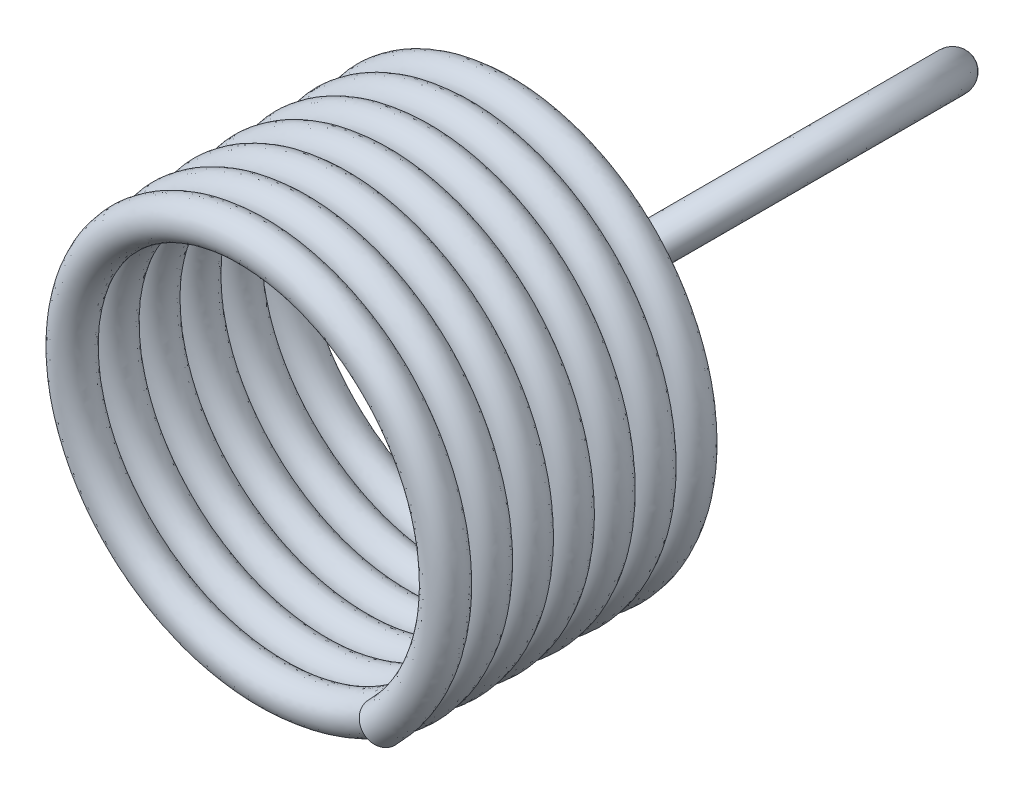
ISO-10303-21;
HEADER;
FILE_DESCRIPTION(('STEP AP214'),'2;1');
FILE_NAME('part.step','',(''),(''),'','','');
FILE_SCHEMA(('AUTOMOTIVE_DESIGN { 1 0 10303 214 1 1 1 1 }'));
ENDSEC;
DATA;
#1=APPLICATION_CONTEXT('core data for automotive mechanical design processes');
#2=APPLICATION_PROTOCOL_DEFINITION('international standard','automotive_design',2000,#1);
#3=PRODUCT_CONTEXT('',#1,'mechanical');
#4=PRODUCT('Part','Part','',(#3));
#5=PRODUCT_RELATED_PRODUCT_CATEGORY('part','',(#4));
#6=PRODUCT_DEFINITION_FORMATION('','',#4);
#7=PRODUCT_DEFINITION_CONTEXT('part definition',#1,'design');
#8=PRODUCT_DEFINITION('design','',#6,#7);
#9=PRODUCT_DEFINITION_SHAPE('','',#8);
#10=(LENGTH_UNIT() NAMED_UNIT(*) SI_UNIT(.MILLI.,.METRE.));
#11=(NAMED_UNIT(*) PLANE_ANGLE_UNIT() SI_UNIT($,.RADIAN.));
#12=(NAMED_UNIT(*) SI_UNIT($,.STERADIAN.) SOLID_ANGLE_UNIT());
#13=UNCERTAINTY_MEASURE_WITH_UNIT(LENGTH_MEASURE(1.E-05),#10,'distance_accuracy_value','');
#14=(GEOMETRIC_REPRESENTATION_CONTEXT(3) GLOBAL_UNCERTAINTY_ASSIGNED_CONTEXT((#13)) GLOBAL_UNIT_ASSIGNED_CONTEXT((#10,
#11,#12)) REPRESENTATION_CONTEXT('',''));
#15=CARTESIAN_POINT('',(0.,0.,0.));
#16=DIRECTION('',(0.,0.,1.));
#17=DIRECTION('',(1.,0.,0.));
#18=AXIS2_PLACEMENT_3D('',#15,#16,#17);
#19=CARTESIAN_POINT('',(1.23360678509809,-1.2449180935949,2.24870278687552));
#20=DIRECTION('',(0.710326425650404,0.703872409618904,0.));
#21=DIRECTION('',(-0.703872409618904,0.710326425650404,0.));
#22=AXIS2_PLACEMENT_3D('',#19,#20,#21);
#23=PLANE('',#22);
#24=CARTESIAN_POINT('',(1.23360678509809,-1.2449180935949,2.24870278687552));
#25=CARTESIAN_POINT('',(1.246618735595,-1.25804935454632,2.24870926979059));
#26=CARTESIAN_POINT('',(1.25972694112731,-1.27127775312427,2.25186622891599));
#27=CARTESIAN_POINT('',(1.28441850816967,-1.29619572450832,2.26415311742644));
#28=CARTESIAN_POINT('',(1.29600186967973,-1.30788529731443,2.27328304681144));
#29=CARTESIAN_POINT('',(1.31640197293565,-1.32847245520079,2.29647905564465));
#30=CARTESIAN_POINT('',(1.32521871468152,-1.33737004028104,2.31054513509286));
#31=CARTESIAN_POINT('',(1.33907441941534,-1.3513527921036,2.34202961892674));
#32=CARTESIAN_POINT('',(1.34411338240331,-1.35643795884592,2.35944802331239));
#33=CARTESIAN_POINT('',(1.34984981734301,-1.36222699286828,2.39567277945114));
#34=CARTESIAN_POINT('',(1.35054728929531,-1.36293086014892,2.41447913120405));
#35=CARTESIAN_POINT('',(1.34752167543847,-1.35987750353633,2.45135982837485));
#36=CARTESIAN_POINT('',(1.34379858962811,-1.35612027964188,2.46943417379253));
#37=CARTESIAN_POINT('',(1.33234894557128,-1.3445656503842,2.50281241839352));
#38=CARTESIAN_POINT('',(1.32462238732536,-1.33676824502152,2.51811631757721));
#39=CARTESIAN_POINT('',(1.30604799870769,-1.31802354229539,2.54423072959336));
#40=CARTESIAN_POINT('',(1.29520016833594,-1.30707624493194,2.55504124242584));
#41=CARTESIAN_POINT('',(1.27156455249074,-1.28322390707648,2.57094093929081));
#42=CARTESIAN_POINT('',(1.25877676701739,-1.27031886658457,2.57603012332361));
#43=CARTESIAN_POINT('',(1.23940801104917,-1.25077251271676,2.57895759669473));
#44=CARTESIAN_POINT('',(1.23295641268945,-1.2442617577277,2.57916053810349));
#45=CARTESIAN_POINT('',(1.21351543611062,-1.22464252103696,2.5774538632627));
#46=CARTESIAN_POINT('',(1.20058163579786,-1.21159012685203,2.57317377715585));
#47=CARTESIAN_POINT('',(1.17647384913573,-1.18726128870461,2.55877589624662));
#48=CARTESIAN_POINT('',(1.16529986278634,-1.1759848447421,2.54865810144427));
#49=CARTESIAN_POINT('',(1.14593011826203,-1.15643749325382,2.52373725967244));
#50=CARTESIAN_POINT('',(1.1377343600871,-1.14816658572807,2.50893421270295));
#51=CARTESIAN_POINT('',(1.12525608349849,-1.13557389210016,2.47630864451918));
#52=CARTESIAN_POINT('',(1.12097356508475,-1.13125210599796,2.45848612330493));
#53=CARTESIAN_POINT('',(1.11680194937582,-1.12704223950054,2.42183182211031));
#54=CARTESIAN_POINT('',(1.11691285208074,-1.12715415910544,2.40300004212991));
#55=CARTESIAN_POINT('',(1.12151513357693,-1.13179864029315,2.36645007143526));
#56=CARTESIAN_POINT('',(1.12600651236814,-1.13633120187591,2.348731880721));
#57=CARTESIAN_POINT('',(1.13886778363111,-1.14931040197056,2.31640698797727));
#58=CARTESIAN_POINT('',(1.14723767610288,-1.15775704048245,2.30180028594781));
#59=CARTESIAN_POINT('',(1.16689514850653,-1.1775947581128,2.27734422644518));
#60=CARTESIAN_POINT('',(1.17818272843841,-1.18898583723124,2.267494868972));
#61=CARTESIAN_POINT('',(1.20246731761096,-1.21349309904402,2.25366738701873));
#62=CARTESIAN_POINT('',(1.21546432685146,-1.22660928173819,2.24968926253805));
#63=CARTESIAN_POINT('',(1.23017723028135,-1.24145709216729,2.24875584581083));
#64=CARTESIAN_POINT('',(1.23189117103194,-1.24318674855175,2.24870193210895));
#65=CARTESIAN_POINT('',(1.23360678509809,-1.2449180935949,2.24870278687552));
#66=B_SPLINE_CURVE_WITH_KNOTS('',3,(#24,#25,#26,#27,#28,#29,#30,#31,#32,#33,#34,#35,#36,#37,#38,
#39,#40,#41,#42,#43,#44,#45,#46,#47,#48,#49,#50,#51,#52,#53,#54,#55,#56,#57,#58,#59,#60,#61,#62,
#63,#64,#65),.UNSPECIFIED.,.T.,.F.,(4,2,2,2,2,2,2,2,2,2,2,2,2,2,2,2,2,2,2,2,4),(0.,
0.0554358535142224,0.110871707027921,0.166307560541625,0.221743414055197,0.277179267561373,
0.332615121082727,0.388050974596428,0.443486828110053,0.498922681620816,0.526341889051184,
0.581777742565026,0.637213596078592,0.692649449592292,0.74808530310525,0.803521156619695,
0.858957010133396,0.914392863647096,0.969828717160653,1.02526457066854,1.03257373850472),.UNSPECIFIED.);
#67=CARTESIAN_POINT('',(1.23360678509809,-1.2449180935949,2.24870278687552));
#68=VERTEX_POINT('',#67);
#69=EDGE_CURVE('E14',#68,#68,#66,.F.);
#70=ORIENTED_EDGE('',*,*,#69,.F.);
#71=EDGE_LOOP('',(#70));
#72=FACE_BOUND('',#71,.T.);
#73=ADVANCED_FACE('F391',(#72),#23,.F.);
#74=CARTESIAN_POINT('',(-1.7526,0.,0.1651));
#75=CARTESIAN_POINT('',(-1.7526,1.01186408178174,0.195452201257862));
#76=CARTESIAN_POINT('',(-0.876300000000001,1.51779612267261,0.225804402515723));
#77=CARTESIAN_POINT('',(0.,2.02372816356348,0.256156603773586));
#78=CARTESIAN_POINT('',(0.8763,1.51779612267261,0.286508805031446));
#79=CARTESIAN_POINT('',(1.7526,1.01186408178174,0.316861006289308));
#80=CARTESIAN_POINT('',(1.7526,0.,0.347213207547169));
#81=CARTESIAN_POINT('',(1.7526,-1.01186408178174,0.377565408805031));
#82=CARTESIAN_POINT('',(0.876300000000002,-1.51779612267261,0.407917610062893));
#83=CARTESIAN_POINT('',(0.,-2.02372816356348,0.438269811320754));
#84=CARTESIAN_POINT('',(-0.876299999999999,-1.51779612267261,0.468622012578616));
#85=CARTESIAN_POINT('',(-1.7526,-1.01186408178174,0.498974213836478));
#86=CARTESIAN_POINT('',(-1.7526,0.,0.529326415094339));
#87=CARTESIAN_POINT('',(-1.7526,1.01186408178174,0.559678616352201));
#88=CARTESIAN_POINT('',(-0.876300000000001,1.51779612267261,0.590030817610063));
#89=CARTESIAN_POINT('',(0.,2.02372816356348,0.620383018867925));
#90=CARTESIAN_POINT('',(0.8763,1.51779612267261,0.650735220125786));
#91=CARTESIAN_POINT('',(1.7526,1.01186408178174,0.681087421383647));
#92=CARTESIAN_POINT('',(1.7526,0.,0.711439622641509));
#93=CARTESIAN_POINT('',(1.7526,-1.01186408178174,0.741791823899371));
#94=CARTESIAN_POINT('',(0.876300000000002,-1.51779612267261,0.772144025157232));
#95=CARTESIAN_POINT('',(0.,-2.02372816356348,0.802496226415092));
#96=CARTESIAN_POINT('',(-0.876299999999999,-1.51779612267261,0.832848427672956));
#97=CARTESIAN_POINT('',(-1.7526,-1.01186408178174,0.863200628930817));
#98=CARTESIAN_POINT('',(-1.7526,0.,0.893552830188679));
#99=CARTESIAN_POINT('',(-1.7526,1.01186408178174,0.923905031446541));
#100=CARTESIAN_POINT('',(-0.876300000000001,1.51779612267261,0.954257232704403));
#101=CARTESIAN_POINT('',(0.,2.02372816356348,0.984609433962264));
#102=CARTESIAN_POINT('',(0.8763,1.51779612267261,1.01496163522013));
#103=CARTESIAN_POINT('',(1.7526,1.01186408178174,1.04531383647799));
#104=CARTESIAN_POINT('',(1.7526,0.,1.07566603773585));
#105=CARTESIAN_POINT('',(1.7526,-1.01186408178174,1.10601823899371));
#106=CARTESIAN_POINT('',(0.876300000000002,-1.51779612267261,1.13637044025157));
#107=CARTESIAN_POINT('',(0.,-2.02372816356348,1.16672264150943));
#108=CARTESIAN_POINT('',(-0.876299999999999,-1.51779612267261,1.19707484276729));
#109=CARTESIAN_POINT('',(-1.7526,-1.01186408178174,1.22742704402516));
#110=CARTESIAN_POINT('',(-1.7526,0.,1.25777924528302));
#111=CARTESIAN_POINT('',(-1.7526,1.01186408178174,1.28813144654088));
#112=CARTESIAN_POINT('',(-0.876300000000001,1.51779612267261,1.31848364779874));
#113=CARTESIAN_POINT('',(0.,2.02372816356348,1.3488358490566));
#114=CARTESIAN_POINT('',(0.8763,1.51779612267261,1.37918805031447));
#115=CARTESIAN_POINT('',(1.7526,1.01186408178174,1.40954025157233));
#116=CARTESIAN_POINT('',(1.7526,0.,1.43989245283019));
#117=CARTESIAN_POINT('',(1.7526,-1.01186408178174,1.47024465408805));
#118=CARTESIAN_POINT('',(0.876300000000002,-1.51779612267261,1.50059685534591));
#119=CARTESIAN_POINT('',(0.,-2.02372816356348,1.53094905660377));
#120=CARTESIAN_POINT('',(-0.876299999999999,-1.51779612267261,1.56130125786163));
#121=CARTESIAN_POINT('',(-1.7526,-1.01186408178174,1.5916534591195));
#122=CARTESIAN_POINT('',(-1.7526,0.,1.62200566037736));
#123=CARTESIAN_POINT('',(-1.7526,1.01186408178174,1.65235786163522));
#124=CARTESIAN_POINT('',(-0.876300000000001,1.51779612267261,1.68271006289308));
#125=CARTESIAN_POINT('',(0.,2.02372816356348,1.71306226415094));
#126=CARTESIAN_POINT('',(0.8763,1.51779612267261,1.7434144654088));
#127=CARTESIAN_POINT('',(1.7526,1.01186408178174,1.77376666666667));
#128=CARTESIAN_POINT('',(1.7526,0.,1.80411886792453));
#129=CARTESIAN_POINT('',(1.7526,-1.01186408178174,1.83447106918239));
#130=CARTESIAN_POINT('',(0.876300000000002,-1.51779612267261,1.86482327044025));
#131=CARTESIAN_POINT('',(0.,-2.02372816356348,1.89517547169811));
#132=CARTESIAN_POINT('',(-0.876299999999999,-1.51779612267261,1.92552767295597));
#133=CARTESIAN_POINT('',(-1.7526,-1.01186408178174,1.95587987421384));
#134=CARTESIAN_POINT('',(-1.7526,0.,1.9862320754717));
#135=CARTESIAN_POINT('',(-1.7526,1.01186408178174,2.01658427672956));
#136=CARTESIAN_POINT('',(-0.876300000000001,1.51779612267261,2.04693647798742));
#137=CARTESIAN_POINT('',(0.,2.02372816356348,2.07728867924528));
#138=CARTESIAN_POINT('',(0.8763,1.51779612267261,2.10764088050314));
#139=CARTESIAN_POINT('',(1.7526,1.01186408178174,2.13799308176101));
#140=CARTESIAN_POINT('',(1.7526,0.,2.16834528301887));
#141=CARTESIAN_POINT('',(1.7526,-1.01186408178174,2.19869748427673));
#142=CARTESIAN_POINT('',(0.876300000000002,-1.51779612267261,2.22904968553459));
#143=CARTESIAN_POINT('',(0.,-2.02372816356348,2.25940188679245));
#144=CARTESIAN_POINT('',(-0.876299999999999,-1.51779612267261,2.28975408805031));
#145=CARTESIAN_POINT('',(-1.7526,-1.01186408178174,2.32010628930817));
#146=CARTESIAN_POINT('',(-1.7526,0.,2.35045849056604));
#147=CARTESIAN_POINT('',(-1.7526,1.01186408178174,2.3808106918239));
#148=CARTESIAN_POINT('',(-0.876300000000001,1.51779612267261,2.41116289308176));
#149=CARTESIAN_POINT('',(0.,2.02372816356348,2.44151509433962));
#150=CARTESIAN_POINT('',(0.8763,1.51779612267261,2.47186729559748));
#151=CARTESIAN_POINT('',(1.7526,1.01186408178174,2.50221949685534));
#152=CARTESIAN_POINT('',(1.7526,0.,2.53257169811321));
#153=CARTESIAN_POINT('',(1.7526,-0.730640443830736,2.55448822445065));
#154=CARTESIAN_POINT('',(1.23360678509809,-1.2449180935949,2.57890278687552));
#155=CARTESIAN_POINT('',(-1.70941261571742,0.,0.1651));
#156=CARTESIAN_POINT('',(-1.70941261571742,0.986929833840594,0.195452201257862));
#157=CARTESIAN_POINT('',(-0.854706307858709,1.48039475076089,0.225804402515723));
#158=CARTESIAN_POINT('',(0.,1.97385966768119,0.256156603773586));
#159=CARTESIAN_POINT('',(0.85470630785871,1.48039475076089,0.286508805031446));
#160=CARTESIAN_POINT('',(1.70941261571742,0.986929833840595,0.316861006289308));
#161=CARTESIAN_POINT('',(1.70941261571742,0.,0.347213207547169));
#162=CARTESIAN_POINT('',(1.70941261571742,-0.986929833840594,0.377565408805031));
#163=CARTESIAN_POINT('',(0.854706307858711,-1.48039475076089,0.407917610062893));
#164=CARTESIAN_POINT('',(0.,-1.97385966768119,0.438269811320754));
#165=CARTESIAN_POINT('',(-0.854706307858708,-1.48039475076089,0.468622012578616));
#166=CARTESIAN_POINT('',(-1.70941261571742,-0.986929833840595,0.498974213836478));
#167=CARTESIAN_POINT('',(-1.70941261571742,0.,0.529326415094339));
#168=CARTESIAN_POINT('',(-1.70941261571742,0.986929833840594,0.559678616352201));
#169=CARTESIAN_POINT('',(-0.854706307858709,1.48039475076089,0.590030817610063));
#170=CARTESIAN_POINT('',(0.,1.97385966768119,0.620383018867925));
#171=CARTESIAN_POINT('',(0.85470630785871,1.48039475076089,0.650735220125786));
#172=CARTESIAN_POINT('',(1.70941261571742,0.986929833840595,0.681087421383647));
#173=CARTESIAN_POINT('',(1.70941261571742,0.,0.711439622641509));
#174=CARTESIAN_POINT('',(1.70941261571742,-0.986929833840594,0.741791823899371));
#175=CARTESIAN_POINT('',(0.854706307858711,-1.48039475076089,0.772144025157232));
#176=CARTESIAN_POINT('',(0.,-1.97385966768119,0.802496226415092));
#177=CARTESIAN_POINT('',(-0.854706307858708,-1.48039475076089,0.832848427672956));
#178=CARTESIAN_POINT('',(-1.70941261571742,-0.986929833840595,0.863200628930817));
#179=CARTESIAN_POINT('',(-1.70941261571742,0.,0.893552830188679));
#180=CARTESIAN_POINT('',(-1.70941261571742,0.986929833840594,0.923905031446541));
#181=CARTESIAN_POINT('',(-0.854706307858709,1.48039475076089,0.954257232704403));
#182=CARTESIAN_POINT('',(0.,1.97385966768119,0.984609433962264));
#183=CARTESIAN_POINT('',(0.85470630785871,1.48039475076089,1.01496163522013));
#184=CARTESIAN_POINT('',(1.70941261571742,0.986929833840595,1.04531383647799));
#185=CARTESIAN_POINT('',(1.70941261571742,0.,1.07566603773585));
#186=CARTESIAN_POINT('',(1.70941261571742,-0.986929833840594,1.10601823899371));
#187=CARTESIAN_POINT('',(0.854706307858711,-1.48039475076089,1.13637044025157));
#188=CARTESIAN_POINT('',(0.,-1.97385966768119,1.16672264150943));
#189=CARTESIAN_POINT('',(-0.854706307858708,-1.48039475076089,1.19707484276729));
#190=CARTESIAN_POINT('',(-1.70941261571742,-0.986929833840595,1.22742704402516));
#191=CARTESIAN_POINT('',(-1.70941261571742,0.,1.25777924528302));
#192=CARTESIAN_POINT('',(-1.70941261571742,0.986929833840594,1.28813144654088));
#193=CARTESIAN_POINT('',(-0.854706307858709,1.48039475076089,1.31848364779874));
#194=CARTESIAN_POINT('',(0.,1.97385966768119,1.3488358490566));
#195=CARTESIAN_POINT('',(0.85470630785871,1.48039475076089,1.37918805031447));
#196=CARTESIAN_POINT('',(1.70941261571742,0.986929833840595,1.40954025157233));
#197=CARTESIAN_POINT('',(1.70941261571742,0.,1.43989245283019));
#198=CARTESIAN_POINT('',(1.70941261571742,-0.986929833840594,1.47024465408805));
#199=CARTESIAN_POINT('',(0.85470630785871,-1.48039475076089,1.50059685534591));
#200=CARTESIAN_POINT('',(0.,-1.97385966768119,1.53094905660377));
#201=CARTESIAN_POINT('',(-0.854706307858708,-1.48039475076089,1.56130125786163));
#202=CARTESIAN_POINT('',(-1.70941261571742,-0.986929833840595,1.5916534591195));
#203=CARTESIAN_POINT('',(-1.70941261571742,0.,1.62200566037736));
#204=CARTESIAN_POINT('',(-1.70941261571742,0.986929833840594,1.65235786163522));
#205=CARTESIAN_POINT('',(-0.85470630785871,1.48039475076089,1.68271006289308));
#206=CARTESIAN_POINT('',(0.,1.97385966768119,1.71306226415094));
#207=CARTESIAN_POINT('',(0.85470630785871,1.48039475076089,1.7434144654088));
#208=CARTESIAN_POINT('',(1.70941261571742,0.986929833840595,1.77376666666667));
#209=CARTESIAN_POINT('',(1.70941261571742,0.,1.80411886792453));
#210=CARTESIAN_POINT('',(1.70941261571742,-0.986929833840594,1.83447106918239));
#211=CARTESIAN_POINT('',(0.85470630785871,-1.48039475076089,1.86482327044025));
#212=CARTESIAN_POINT('',(0.,-1.97385966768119,1.89517547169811));
#213=CARTESIAN_POINT('',(-0.854706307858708,-1.48039475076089,1.92552767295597));
#214=CARTESIAN_POINT('',(-1.70941261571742,-0.986929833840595,1.95587987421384));
#215=CARTESIAN_POINT('',(-1.70941261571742,0.,1.9862320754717));
#216=CARTESIAN_POINT('',(-1.70941261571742,0.986929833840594,2.01658427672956));
#217=CARTESIAN_POINT('',(-0.85470630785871,1.48039475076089,2.04693647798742));
#218=CARTESIAN_POINT('',(0.,1.97385966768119,2.07728867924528));
#219=CARTESIAN_POINT('',(0.85470630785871,1.48039475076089,2.10764088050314));
#220=CARTESIAN_POINT('',(1.70941261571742,0.986929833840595,2.13799308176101));
#221=CARTESIAN_POINT('',(1.70941261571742,0.,2.16834528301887));
#222=CARTESIAN_POINT('',(1.70941261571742,-0.986929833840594,2.19869748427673));
#223=CARTESIAN_POINT('',(0.85470630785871,-1.48039475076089,2.22904968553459));
#224=CARTESIAN_POINT('',(0.,-1.97385966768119,2.25940188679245));
#225=CARTESIAN_POINT('',(-0.854706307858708,-1.48039475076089,2.28975408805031));
#226=CARTESIAN_POINT('',(-1.70941261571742,-0.986929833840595,2.32010628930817));
#227=CARTESIAN_POINT('',(-1.70941261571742,0.,2.35045849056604));
#228=CARTESIAN_POINT('',(-1.70941261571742,0.986929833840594,2.3808106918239));
#229=CARTESIAN_POINT('',(-0.85470630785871,1.48039475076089,2.41116289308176));
#230=CARTESIAN_POINT('',(0.,1.97385966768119,2.44151509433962));
#231=CARTESIAN_POINT('',(0.85470630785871,1.48039475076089,2.47186729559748));
#232=CARTESIAN_POINT('',(1.70941261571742,0.986929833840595,2.50221949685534));
#233=CARTESIAN_POINT('',(1.70941261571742,0.,2.53257169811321));
#234=CARTESIAN_POINT('',(1.70941261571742,-0.712636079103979,2.55448822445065));
#235=CARTESIAN_POINT('',(1.20320837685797,-1.21424095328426,2.57890278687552));
#236=CARTESIAN_POINT('',(-1.5875,0.,0.140257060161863));
#237=CARTESIAN_POINT('',(-1.5875,0.916543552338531,0.170609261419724));
#238=CARTESIAN_POINT('',(-0.793750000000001,1.3748153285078,0.200961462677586));
#239=CARTESIAN_POINT('',(0.,1.83308710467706,0.231313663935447));
#240=CARTESIAN_POINT('',(0.79375,1.3748153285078,0.261665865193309));
#241=CARTESIAN_POINT('',(1.5875,0.916543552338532,0.292018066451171));
#242=CARTESIAN_POINT('',(1.5875,0.,0.322370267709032));
#243=CARTESIAN_POINT('',(1.5875,-0.916543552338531,0.352722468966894));
#244=CARTESIAN_POINT('',(0.793750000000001,-1.3748153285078,0.383074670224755));
#245=CARTESIAN_POINT('',(0.,-1.83308710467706,0.413426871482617));
#246=CARTESIAN_POINT('',(-0.79375,-1.3748153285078,0.443779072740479));
#247=CARTESIAN_POINT('',(-1.5875,-0.916543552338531,0.47413127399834));
#248=CARTESIAN_POINT('',(-1.5875,0.,0.504483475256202));
#249=CARTESIAN_POINT('',(-1.5875,0.916543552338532,0.534835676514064));
#250=CARTESIAN_POINT('',(-0.793750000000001,1.3748153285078,0.565187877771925));
#251=CARTESIAN_POINT('',(0.,1.83308710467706,0.595540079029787));
#252=CARTESIAN_POINT('',(0.79375,1.3748153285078,0.625892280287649));
#253=CARTESIAN_POINT('',(1.5875,0.916543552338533,0.65624448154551));
#254=CARTESIAN_POINT('',(1.5875,0.,0.686596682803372));
#255=CARTESIAN_POINT('',(1.5875,-0.91654355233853,0.716948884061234));
#256=CARTESIAN_POINT('',(0.793750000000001,-1.3748153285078,0.747301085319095));
#257=CARTESIAN_POINT('',(0.,-1.83308710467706,0.777653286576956));
#258=CARTESIAN_POINT('',(-0.79375,-1.3748153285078,0.808005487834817));
#259=CARTESIAN_POINT('',(-1.5875,-0.916543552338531,0.83835768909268));
#260=CARTESIAN_POINT('',(-1.5875,0.,0.868709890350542));
#261=CARTESIAN_POINT('',(-1.5875,0.916543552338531,0.899062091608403));
#262=CARTESIAN_POINT('',(-0.793750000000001,1.3748153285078,0.929414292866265));
#263=CARTESIAN_POINT('',(0.,1.83308710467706,0.959766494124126));
#264=CARTESIAN_POINT('',(0.79375,1.3748153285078,0.990118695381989));
#265=CARTESIAN_POINT('',(1.5875,0.916543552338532,1.02047089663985));
#266=CARTESIAN_POINT('',(1.5875,0.,1.05082309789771));
#267=CARTESIAN_POINT('',(1.5875,-0.916543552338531,1.08117529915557));
#268=CARTESIAN_POINT('',(0.793750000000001,-1.3748153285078,1.11152750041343));
#269=CARTESIAN_POINT('',(0.,-1.83308710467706,1.1418797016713));
#270=CARTESIAN_POINT('',(-0.79375,-1.3748153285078,1.17223190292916));
#271=CARTESIAN_POINT('',(-1.5875,-0.916543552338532,1.20258410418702));
#272=CARTESIAN_POINT('',(-1.5875,0.,1.23293630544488));
#273=CARTESIAN_POINT('',(-1.5875,0.916543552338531,1.26328850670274));
#274=CARTESIAN_POINT('',(-0.793750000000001,1.3748153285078,1.2936407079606));
#275=CARTESIAN_POINT('',(0.,1.83308710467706,1.32399290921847));
#276=CARTESIAN_POINT('',(0.79375,1.3748153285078,1.35434511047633));
#277=CARTESIAN_POINT('',(1.5875,0.916543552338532,1.38469731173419));
#278=CARTESIAN_POINT('',(1.5875,0.,1.41504951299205));
#279=CARTESIAN_POINT('',(1.5875,-0.916543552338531,1.44540171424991));
#280=CARTESIAN_POINT('',(0.793750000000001,-1.3748153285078,1.47575391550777));
#281=CARTESIAN_POINT('',(0.,-1.83308710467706,1.50610611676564));
#282=CARTESIAN_POINT('',(-0.79375,-1.3748153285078,1.5364583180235));
#283=CARTESIAN_POINT('',(-1.5875,-0.916543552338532,1.56681051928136));
#284=CARTESIAN_POINT('',(-1.5875,0.,1.59716272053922));
#285=CARTESIAN_POINT('',(-1.5875,0.916543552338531,1.62751492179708));
#286=CARTESIAN_POINT('',(-0.793750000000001,1.3748153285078,1.65786712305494));
#287=CARTESIAN_POINT('',(0.,1.83308710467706,1.6882193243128));
#288=CARTESIAN_POINT('',(0.79375,1.3748153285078,1.71857152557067));
#289=CARTESIAN_POINT('',(1.5875,0.916543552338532,1.74892372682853));
#290=CARTESIAN_POINT('',(1.5875,0.,1.77927592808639));
#291=CARTESIAN_POINT('',(1.5875,-0.916543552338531,1.80962812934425));
#292=CARTESIAN_POINT('',(0.793750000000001,-1.3748153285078,1.83998033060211));
#293=CARTESIAN_POINT('',(0.,-1.83308710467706,1.87033253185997));
#294=CARTESIAN_POINT('',(-0.79375,-1.3748153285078,1.90068473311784));
#295=CARTESIAN_POINT('',(-1.5875,-0.916543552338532,1.9310369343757));
#296=CARTESIAN_POINT('',(-1.5875,0.,1.96138913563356));
#297=CARTESIAN_POINT('',(-1.5875,0.916543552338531,1.99174133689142));
#298=CARTESIAN_POINT('',(-0.793750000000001,1.3748153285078,2.02209353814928));
#299=CARTESIAN_POINT('',(0.,1.83308710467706,2.05244573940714));
#300=CARTESIAN_POINT('',(0.79375,1.3748153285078,2.08279794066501));
#301=CARTESIAN_POINT('',(1.5875,0.916543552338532,2.11315014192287));
#302=CARTESIAN_POINT('',(1.5875,0.,2.14350234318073));
#303=CARTESIAN_POINT('',(1.5875,-0.91654355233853,2.17385454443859));
#304=CARTESIAN_POINT('',(0.793750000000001,-1.3748153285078,2.20420674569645));
#305=CARTESIAN_POINT('',(0.,-1.83308710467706,2.23455894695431));
#306=CARTESIAN_POINT('',(-0.79375,-1.3748153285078,2.26491114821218));
#307=CARTESIAN_POINT('',(-1.5875,-0.916543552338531,2.29526334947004));
#308=CARTESIAN_POINT('',(-1.5875,0.,2.3256155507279));
#309=CARTESIAN_POINT('',(-1.5875,0.916543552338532,2.35596775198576));
#310=CARTESIAN_POINT('',(-0.793750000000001,1.3748153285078,2.38631995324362));
#311=CARTESIAN_POINT('',(0.,1.83308710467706,2.41667215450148));
#312=CARTESIAN_POINT('',(0.79375,1.3748153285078,2.44702435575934));
#313=CARTESIAN_POINT('',(1.5875,0.916543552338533,2.47737655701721));
#314=CARTESIAN_POINT('',(1.5875,0.,2.50772875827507));
#315=CARTESIAN_POINT('',(1.5875,-0.661811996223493,2.52964528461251));
#316=CARTESIAN_POINT('',(1.11739745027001,-1.12764320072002,2.55405984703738));
#317=CARTESIAN_POINT('',(-1.5875,0.,-0.140257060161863));
#318=CARTESIAN_POINT('',(-1.5875,0.916543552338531,-0.109904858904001));
#319=CARTESIAN_POINT('',(-0.793750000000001,1.3748153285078,-0.0795526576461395));
#320=CARTESIAN_POINT('',(0.,1.83308710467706,-0.0492004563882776));
#321=CARTESIAN_POINT('',(0.79375,1.3748153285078,-0.0188482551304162));
#322=CARTESIAN_POINT('',(1.5875,0.916543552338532,0.0115039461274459));
#323=CARTESIAN_POINT('',(1.5875,0.,0.0418561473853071));
#324=CARTESIAN_POINT('',(1.5875,-0.916543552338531,0.0722083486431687));
#325=CARTESIAN_POINT('',(0.793750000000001,-1.3748153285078,0.10256054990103));
#326=CARTESIAN_POINT('',(0.,-1.83308710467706,0.132912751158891));
#327=CARTESIAN_POINT('',(-0.79375,-1.3748153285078,0.163264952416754));
#328=CARTESIAN_POINT('',(-1.5875,-0.916543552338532,0.193617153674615));
#329=CARTESIAN_POINT('',(-1.5875,0.,0.223969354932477));
#330=CARTESIAN_POINT('',(-1.5875,0.916543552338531,0.254321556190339));
#331=CARTESIAN_POINT('',(-0.793750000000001,1.3748153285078,0.2846737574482));
#332=CARTESIAN_POINT('',(0.,1.83308710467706,0.315025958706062));
#333=CARTESIAN_POINT('',(0.79375,1.3748153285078,0.345378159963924));
#334=CARTESIAN_POINT('',(1.5875,0.916543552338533,0.375730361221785));
#335=CARTESIAN_POINT('',(1.5875,0.,0.406082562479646));
#336=CARTESIAN_POINT('',(1.5875,-0.91654355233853,0.436434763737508));
#337=CARTESIAN_POINT('',(0.793750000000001,-1.3748153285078,0.46678696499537));
#338=CARTESIAN_POINT('',(0.,-1.83308710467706,0.497139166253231));
#339=CARTESIAN_POINT('',(-0.79375,-1.3748153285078,0.527491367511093));
#340=CARTESIAN_POINT('',(-1.5875,-0.916543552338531,0.557843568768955));
#341=CARTESIAN_POINT('',(-1.5875,0.,0.588195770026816));
#342=CARTESIAN_POINT('',(-1.5875,0.916543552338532,0.618547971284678));
#343=CARTESIAN_POINT('',(-0.793750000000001,1.3748153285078,0.64890017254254));
#344=CARTESIAN_POINT('',(0.,1.83308710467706,0.679252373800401));
#345=CARTESIAN_POINT('',(0.79375,1.3748153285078,0.709604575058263));
#346=CARTESIAN_POINT('',(1.5875,0.916543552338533,0.739956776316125));
#347=CARTESIAN_POINT('',(1.5875,0.,0.770308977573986));
#348=CARTESIAN_POINT('',(1.5875,-0.91654355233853,0.800661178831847));
#349=CARTESIAN_POINT('',(0.793750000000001,-1.3748153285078,0.831013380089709));
#350=CARTESIAN_POINT('',(0.,-1.83308710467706,0.861365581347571));
#351=CARTESIAN_POINT('',(-0.79375,-1.3748153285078,0.891717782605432));
#352=CARTESIAN_POINT('',(-1.5875,-0.916543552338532,0.922069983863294));
#353=CARTESIAN_POINT('',(-1.5875,0.,0.952422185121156));
#354=CARTESIAN_POINT('',(-1.5875,0.916543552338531,0.982774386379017));
#355=CARTESIAN_POINT('',(-0.793750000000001,1.3748153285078,1.01312658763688));
#356=CARTESIAN_POINT('',(0.,1.83308710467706,1.04347878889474));
#357=CARTESIAN_POINT('',(0.79375,1.3748153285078,1.0738309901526));
#358=CARTESIAN_POINT('',(1.5875,0.916543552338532,1.10418319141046));
#359=CARTESIAN_POINT('',(1.5875,0.,1.13453539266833));
#360=CARTESIAN_POINT('',(1.5875,-0.916543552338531,1.16488759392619));
#361=CARTESIAN_POINT('',(0.793750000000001,-1.3748153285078,1.19523979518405));
#362=CARTESIAN_POINT('',(0.,-1.83308710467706,1.22559199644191));
#363=CARTESIAN_POINT('',(-0.79375,-1.3748153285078,1.25594419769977));
#364=CARTESIAN_POINT('',(-1.5875,-0.916543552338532,1.28629639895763));
#365=CARTESIAN_POINT('',(-1.5875,0.,1.3166486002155));
#366=CARTESIAN_POINT('',(-1.5875,0.916543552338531,1.34700080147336));
#367=CARTESIAN_POINT('',(-0.793750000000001,1.3748153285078,1.37735300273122));
#368=CARTESIAN_POINT('',(0.,1.83308710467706,1.40770520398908));
#369=CARTESIAN_POINT('',(0.79375,1.3748153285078,1.43805740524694));
#370=CARTESIAN_POINT('',(1.5875,0.916543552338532,1.4684096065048));
#371=CARTESIAN_POINT('',(1.5875,0.,1.49876180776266));
#372=CARTESIAN_POINT('',(1.5875,-0.916543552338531,1.52911400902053));
#373=CARTESIAN_POINT('',(0.793750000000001,-1.3748153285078,1.55946621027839));
#374=CARTESIAN_POINT('',(0.,-1.83308710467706,1.58981841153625));
#375=CARTESIAN_POINT('',(-0.79375,-1.3748153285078,1.62017061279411));
#376=CARTESIAN_POINT('',(-1.5875,-0.916543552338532,1.65052281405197));
#377=CARTESIAN_POINT('',(-1.5875,0.,1.68087501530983));
#378=CARTESIAN_POINT('',(-1.5875,0.916543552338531,1.7112272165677));
#379=CARTESIAN_POINT('',(-0.793750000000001,1.3748153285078,1.74157941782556));
#380=CARTESIAN_POINT('',(0.,1.83308710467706,1.77193161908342));
#381=CARTESIAN_POINT('',(0.79375,1.3748153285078,1.80228382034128));
#382=CARTESIAN_POINT('',(1.5875,0.916543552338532,1.83263602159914));
#383=CARTESIAN_POINT('',(1.5875,0.,1.862988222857));
#384=CARTESIAN_POINT('',(1.5875,-0.916543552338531,1.89334042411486));
#385=CARTESIAN_POINT('',(0.793750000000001,-1.3748153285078,1.92369262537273));
#386=CARTESIAN_POINT('',(0.,-1.83308710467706,1.95404482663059));
#387=CARTESIAN_POINT('',(-0.79375,-1.3748153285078,1.98439702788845));
#388=CARTESIAN_POINT('',(-1.5875,-0.916543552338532,2.01474922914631));
#389=CARTESIAN_POINT('',(-1.5875,0.,2.04510143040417));
#390=CARTESIAN_POINT('',(-1.5875,0.916543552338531,2.07545363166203));
#391=CARTESIAN_POINT('',(-0.793750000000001,1.3748153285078,2.1058058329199));
#392=CARTESIAN_POINT('',(0.,1.83308710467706,2.13615803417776));
#393=CARTESIAN_POINT('',(0.79375,1.3748153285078,2.16651023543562));
#394=CARTESIAN_POINT('',(1.5875,0.916543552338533,2.19686243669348));
#395=CARTESIAN_POINT('',(1.5875,0.,2.22721463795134));
#396=CARTESIAN_POINT('',(1.5875,-0.661811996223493,2.24913116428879));
#397=CARTESIAN_POINT('',(1.11739745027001,-1.12764320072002,2.27354572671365));
#398=CARTESIAN_POINT('',(-1.70941261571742,0.,-0.1651));
#399=CARTESIAN_POINT('',(-1.70941261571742,0.986929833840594,-0.134747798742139));
#400=CARTESIAN_POINT('',(-0.854706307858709,1.48039475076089,-0.104395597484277));
#401=CARTESIAN_POINT('',(0.,1.97385966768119,-0.0740433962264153));
#402=CARTESIAN_POINT('',(0.85470630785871,1.48039475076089,-0.0436911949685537));
#403=CARTESIAN_POINT('',(1.70941261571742,0.986929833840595,-0.0133389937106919));
#404=CARTESIAN_POINT('',(1.70941261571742,0.,0.0170132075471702));
#405=CARTESIAN_POINT('',(1.70941261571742,-0.986929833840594,0.0473654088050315));
#406=CARTESIAN_POINT('',(0.854706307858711,-1.48039475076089,0.0777176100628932));
#407=CARTESIAN_POINT('',(0.,-1.97385966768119,0.108069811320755));
#408=CARTESIAN_POINT('',(-0.854706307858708,-1.48039475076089,0.138422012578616));
#409=CARTESIAN_POINT('',(-1.70941261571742,-0.986929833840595,0.168774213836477));
#410=CARTESIAN_POINT('',(-1.70941261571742,0.,0.19912641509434));
#411=CARTESIAN_POINT('',(-1.70941261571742,0.986929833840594,0.229478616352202));
#412=CARTESIAN_POINT('',(-0.854706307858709,1.48039475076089,0.259830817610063));
#413=CARTESIAN_POINT('',(0.,1.97385966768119,0.290183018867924));
#414=CARTESIAN_POINT('',(0.85470630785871,1.48039475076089,0.320535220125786));
#415=CARTESIAN_POINT('',(1.70941261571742,0.986929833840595,0.350887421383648));
#416=CARTESIAN_POINT('',(1.70941261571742,0.,0.381239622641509));
#417=CARTESIAN_POINT('',(1.70941261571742,-0.986929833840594,0.411591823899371));
#418=CARTESIAN_POINT('',(0.854706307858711,-1.48039475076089,0.441944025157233));
#419=CARTESIAN_POINT('',(0.,-1.97385966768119,0.472296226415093));
#420=CARTESIAN_POINT('',(-0.854706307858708,-1.48039475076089,0.502648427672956));
#421=CARTESIAN_POINT('',(-1.70941261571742,-0.986929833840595,0.533000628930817));
#422=CARTESIAN_POINT('',(-1.70941261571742,0.,0.563352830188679));
#423=CARTESIAN_POINT('',(-1.70941261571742,0.986929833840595,0.593705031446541));
#424=CARTESIAN_POINT('',(-0.854706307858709,1.48039475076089,0.624057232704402));
#425=CARTESIAN_POINT('',(0.,1.97385966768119,0.654409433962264));
#426=CARTESIAN_POINT('',(0.85470630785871,1.48039475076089,0.684761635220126));
#427=CARTESIAN_POINT('',(1.70941261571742,0.986929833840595,0.715113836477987));
#428=CARTESIAN_POINT('',(1.70941261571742,0.,0.745466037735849));
#429=CARTESIAN_POINT('',(1.70941261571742,-0.986929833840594,0.77581823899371));
#430=CARTESIAN_POINT('',(0.854706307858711,-1.48039475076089,0.806170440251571));
#431=CARTESIAN_POINT('',(0.,-1.97385966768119,0.836522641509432));
#432=CARTESIAN_POINT('',(-0.854706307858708,-1.48039475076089,0.866874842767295));
#433=CARTESIAN_POINT('',(-1.70941261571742,-0.986929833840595,0.897227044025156));
#434=CARTESIAN_POINT('',(-1.70941261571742,0.,0.927579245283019));
#435=CARTESIAN_POINT('',(-1.70941261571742,0.986929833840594,0.95793144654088));
#436=CARTESIAN_POINT('',(-0.854706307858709,1.48039475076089,0.988283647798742));
#437=CARTESIAN_POINT('',(0.,1.97385966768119,1.0186358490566));
#438=CARTESIAN_POINT('',(0.85470630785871,1.48039475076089,1.04898805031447));
#439=CARTESIAN_POINT('',(1.70941261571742,0.986929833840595,1.07934025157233));
#440=CARTESIAN_POINT('',(1.70941261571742,0.,1.10969245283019));
#441=CARTESIAN_POINT('',(1.70941261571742,-0.986929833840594,1.14004465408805));
#442=CARTESIAN_POINT('',(0.854706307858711,-1.48039475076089,1.17039685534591));
#443=CARTESIAN_POINT('',(0.,-1.97385966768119,1.20074905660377));
#444=CARTESIAN_POINT('',(-0.854706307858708,-1.48039475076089,1.23110125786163));
#445=CARTESIAN_POINT('',(-1.70941261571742,-0.986929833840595,1.2614534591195));
#446=CARTESIAN_POINT('',(-1.70941261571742,0.,1.29180566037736));
#447=CARTESIAN_POINT('',(-1.70941261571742,0.986929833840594,1.32215786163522));
#448=CARTESIAN_POINT('',(-0.854706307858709,1.48039475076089,1.35251006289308));
#449=CARTESIAN_POINT('',(0.,1.97385966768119,1.38286226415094));
#450=CARTESIAN_POINT('',(0.85470630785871,1.48039475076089,1.4132144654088));
#451=CARTESIAN_POINT('',(1.70941261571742,0.986929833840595,1.44356666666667));
#452=CARTESIAN_POINT('',(1.70941261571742,0.,1.47391886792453));
#453=CARTESIAN_POINT('',(1.70941261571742,-0.986929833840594,1.50427106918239));
#454=CARTESIAN_POINT('',(0.85470630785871,-1.48039475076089,1.53462327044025));
#455=CARTESIAN_POINT('',(0.,-1.97385966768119,1.56497547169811));
#456=CARTESIAN_POINT('',(-0.854706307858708,-1.48039475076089,1.59532767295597));
#457=CARTESIAN_POINT('',(-1.70941261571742,-0.986929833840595,1.62567987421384));
#458=CARTESIAN_POINT('',(-1.70941261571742,0.,1.6560320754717));
#459=CARTESIAN_POINT('',(-1.70941261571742,0.986929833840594,1.68638427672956));
#460=CARTESIAN_POINT('',(-0.85470630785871,1.48039475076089,1.71673647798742));
#461=CARTESIAN_POINT('',(0.,1.97385966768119,1.74708867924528));
#462=CARTESIAN_POINT('',(0.85470630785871,1.48039475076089,1.77744088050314));
#463=CARTESIAN_POINT('',(1.70941261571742,0.986929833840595,1.80779308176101));
#464=CARTESIAN_POINT('',(1.70941261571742,0.,1.83814528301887));
#465=CARTESIAN_POINT('',(1.70941261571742,-0.986929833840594,1.86849748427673));
#466=CARTESIAN_POINT('',(0.85470630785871,-1.48039475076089,1.89884968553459));
#467=CARTESIAN_POINT('',(0.,-1.97385966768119,1.92920188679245));
#468=CARTESIAN_POINT('',(-0.854706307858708,-1.48039475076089,1.95955408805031));
#469=CARTESIAN_POINT('',(-1.70941261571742,-0.986929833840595,1.98990628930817));
#470=CARTESIAN_POINT('',(-1.70941261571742,0.,2.02025849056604));
#471=CARTESIAN_POINT('',(-1.70941261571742,0.986929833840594,2.0506106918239));
#472=CARTESIAN_POINT('',(-0.85470630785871,1.48039475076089,2.08096289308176));
#473=CARTESIAN_POINT('',(0.,1.97385966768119,2.11131509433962));
#474=CARTESIAN_POINT('',(0.85470630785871,1.48039475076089,2.14166729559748));
#475=CARTESIAN_POINT('',(1.70941261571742,0.986929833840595,2.17201949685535));
#476=CARTESIAN_POINT('',(1.70941261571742,0.,2.20237169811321));
#477=CARTESIAN_POINT('',(1.70941261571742,-0.712636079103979,2.22428822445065));
#478=CARTESIAN_POINT('',(1.20320837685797,-1.21424095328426,2.24870278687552));
#479=CARTESIAN_POINT('',(-1.79578738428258,0.,-0.1651));
#480=CARTESIAN_POINT('',(-1.79578738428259,1.03679832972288,-0.134747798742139));
#481=CARTESIAN_POINT('',(-0.897893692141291,1.55519749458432,-0.104395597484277));
#482=CARTESIAN_POINT('',(0.,2.07359665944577,-0.0740433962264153));
#483=CARTESIAN_POINT('',(0.897893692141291,1.55519749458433,-0.0436911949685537));
#484=CARTESIAN_POINT('',(1.79578738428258,1.03679832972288,-0.0133389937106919));
#485=CARTESIAN_POINT('',(1.79578738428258,0.,0.0170132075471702));
#486=CARTESIAN_POINT('',(1.79578738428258,-1.03679832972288,0.0473654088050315));
#487=CARTESIAN_POINT('',(0.897893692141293,-1.55519749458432,0.0777176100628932));
#488=CARTESIAN_POINT('',(0.,-2.07359665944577,0.108069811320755));
#489=CARTESIAN_POINT('',(-0.89789369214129,-1.55519749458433,0.138422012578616));
#490=CARTESIAN_POINT('',(-1.79578738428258,-1.03679832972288,0.168774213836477));
#491=CARTESIAN_POINT('',(-1.79578738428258,0.,0.19912641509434));
#492=CARTESIAN_POINT('',(-1.79578738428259,1.03679832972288,0.229478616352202));
#493=CARTESIAN_POINT('',(-0.897893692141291,1.55519749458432,0.259830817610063));
#494=CARTESIAN_POINT('',(0.,2.07359665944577,0.290183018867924));
#495=CARTESIAN_POINT('',(0.897893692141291,1.55519749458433,0.320535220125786));
#496=CARTESIAN_POINT('',(1.79578738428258,1.03679832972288,0.350887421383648));
#497=CARTESIAN_POINT('',(1.79578738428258,0.,0.381239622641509));
#498=CARTESIAN_POINT('',(1.79578738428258,-1.03679832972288,0.411591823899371));
#499=CARTESIAN_POINT('',(0.897893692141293,-1.55519749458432,0.441944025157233));
#500=CARTESIAN_POINT('',(0.,-2.07359665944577,0.472296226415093));
#501=CARTESIAN_POINT('',(-0.89789369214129,-1.55519749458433,0.502648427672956));
#502=CARTESIAN_POINT('',(-1.79578738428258,-1.03679832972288,0.533000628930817));
#503=CARTESIAN_POINT('',(-1.79578738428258,0.,0.563352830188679));
#504=CARTESIAN_POINT('',(-1.79578738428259,1.03679832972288,0.593705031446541));
#505=CARTESIAN_POINT('',(-0.897893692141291,1.55519749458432,0.624057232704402));
#506=CARTESIAN_POINT('',(0.,2.07359665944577,0.654409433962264));
#507=CARTESIAN_POINT('',(0.897893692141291,1.55519749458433,0.684761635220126));
#508=CARTESIAN_POINT('',(1.79578738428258,1.03679832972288,0.715113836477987));
#509=CARTESIAN_POINT('',(1.79578738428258,0.,0.745466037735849));
#510=CARTESIAN_POINT('',(1.79578738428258,-1.03679832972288,0.77581823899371));
#511=CARTESIAN_POINT('',(0.897893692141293,-1.55519749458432,0.806170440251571));
#512=CARTESIAN_POINT('',(0.,-2.07359665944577,0.836522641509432));
#513=CARTESIAN_POINT('',(-0.89789369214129,-1.55519749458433,0.866874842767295));
#514=CARTESIAN_POINT('',(-1.79578738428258,-1.03679832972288,0.897227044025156));
#515=CARTESIAN_POINT('',(-1.79578738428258,0.,0.927579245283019));
#516=CARTESIAN_POINT('',(-1.79578738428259,1.03679832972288,0.95793144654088));
#517=CARTESIAN_POINT('',(-0.897893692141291,1.55519749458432,0.988283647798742));
#518=CARTESIAN_POINT('',(0.,2.07359665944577,1.0186358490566));
#519=CARTESIAN_POINT('',(0.897893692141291,1.55519749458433,1.04898805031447));
#520=CARTESIAN_POINT('',(1.79578738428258,1.03679832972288,1.07934025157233));
#521=CARTESIAN_POINT('',(1.79578738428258,0.,1.10969245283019));
#522=CARTESIAN_POINT('',(1.79578738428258,-1.03679832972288,1.14004465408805));
#523=CARTESIAN_POINT('',(0.897893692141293,-1.55519749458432,1.17039685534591));
#524=CARTESIAN_POINT('',(0.,-2.07359665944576,1.20074905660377));
#525=CARTESIAN_POINT('',(-0.89789369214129,-1.55519749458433,1.23110125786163));
#526=CARTESIAN_POINT('',(-1.79578738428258,-1.03679832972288,1.2614534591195));
#527=CARTESIAN_POINT('',(-1.79578738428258,0.,1.29180566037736));
#528=CARTESIAN_POINT('',(-1.79578738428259,1.03679832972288,1.32215786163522));
#529=CARTESIAN_POINT('',(-0.897893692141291,1.55519749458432,1.35251006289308));
#530=CARTESIAN_POINT('',(0.,2.07359665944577,1.38286226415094));
#531=CARTESIAN_POINT('',(0.897893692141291,1.55519749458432,1.4132144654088));
#532=CARTESIAN_POINT('',(1.79578738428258,1.03679832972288,1.44356666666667));
#533=CARTESIAN_POINT('',(1.79578738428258,0.,1.47391886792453));
#534=CARTESIAN_POINT('',(1.79578738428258,-1.03679832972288,1.50427106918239));
#535=CARTESIAN_POINT('',(0.897893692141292,-1.55519749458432,1.53462327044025));
#536=CARTESIAN_POINT('',(0.,-2.07359665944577,1.56497547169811));
#537=CARTESIAN_POINT('',(-0.89789369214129,-1.55519749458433,1.59532767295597));
#538=CARTESIAN_POINT('',(-1.79578738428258,-1.03679832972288,1.62567987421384));
#539=CARTESIAN_POINT('',(-1.79578738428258,0.,1.6560320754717));
#540=CARTESIAN_POINT('',(-1.79578738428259,1.03679832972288,1.68638427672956));
#541=CARTESIAN_POINT('',(-0.897893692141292,1.55519749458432,1.71673647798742));
#542=CARTESIAN_POINT('',(0.,2.07359665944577,1.74708867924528));
#543=CARTESIAN_POINT('',(0.897893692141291,1.55519749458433,1.77744088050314));
#544=CARTESIAN_POINT('',(1.79578738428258,1.03679832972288,1.80779308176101));
#545=CARTESIAN_POINT('',(1.79578738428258,0.,1.83814528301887));
#546=CARTESIAN_POINT('',(1.79578738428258,-1.03679832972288,1.86849748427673));
#547=CARTESIAN_POINT('',(0.897893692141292,-1.55519749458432,1.89884968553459));
#548=CARTESIAN_POINT('',(0.,-2.07359665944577,1.92920188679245));
#549=CARTESIAN_POINT('',(-0.89789369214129,-1.55519749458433,1.95955408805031));
#550=CARTESIAN_POINT('',(-1.79578738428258,-1.03679832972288,1.98990628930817));
#551=CARTESIAN_POINT('',(-1.79578738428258,0.,2.02025849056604));
#552=CARTESIAN_POINT('',(-1.79578738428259,1.03679832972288,2.0506106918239));
#553=CARTESIAN_POINT('',(-0.897893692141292,1.55519749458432,2.08096289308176));
#554=CARTESIAN_POINT('',(0.,2.07359665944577,2.11131509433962));
#555=CARTESIAN_POINT('',(0.897893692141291,1.55519749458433,2.14166729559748));
#556=CARTESIAN_POINT('',(1.79578738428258,1.03679832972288,2.17201949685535));
#557=CARTESIAN_POINT('',(1.79578738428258,0.,2.20237169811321));
#558=CARTESIAN_POINT('',(1.79578738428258,-0.748644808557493,2.22428822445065));
#559=CARTESIAN_POINT('',(1.26400519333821,-1.27559523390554,2.24870278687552));
#560=CARTESIAN_POINT('',(-1.9177,0.,-0.140257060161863));
#561=CARTESIAN_POINT('',(-1.9177,1.10718461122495,-0.109904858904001));
#562=CARTESIAN_POINT('',(-0.958850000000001,1.66077691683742,-0.0795526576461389));
#563=CARTESIAN_POINT('',(0.,2.21436922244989,-0.0492004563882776));
#564=CARTESIAN_POINT('',(0.95885,1.66077691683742,-0.0188482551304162));
#565=CARTESIAN_POINT('',(1.9177,1.10718461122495,0.0115039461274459));
#566=CARTESIAN_POINT('',(1.9177,0.,0.0418561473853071));
#567=CARTESIAN_POINT('',(1.9177,-1.10718461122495,0.0722083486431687));
#568=CARTESIAN_POINT('',(0.95885,-1.66077691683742,0.10256054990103));
#569=CARTESIAN_POINT('',(0.,-2.21436922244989,0.132912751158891));
#570=CARTESIAN_POINT('',(-0.95885,-1.66077691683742,0.163264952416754));
#571=CARTESIAN_POINT('',(-1.9177,-1.10718461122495,0.193617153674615));
#572=CARTESIAN_POINT('',(-1.9177,0.,0.223969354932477));
#573=CARTESIAN_POINT('',(-1.9177,1.10718461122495,0.254321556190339));
#574=CARTESIAN_POINT('',(-0.958850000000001,1.66077691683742,0.2846737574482));
#575=CARTESIAN_POINT('',(0.,2.21436922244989,0.315025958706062));
#576=CARTESIAN_POINT('',(0.95885,1.66077691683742,0.345378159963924));
#577=CARTESIAN_POINT('',(1.9177,1.10718461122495,0.375730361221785));
#578=CARTESIAN_POINT('',(1.9177,0.,0.406082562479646));
#579=CARTESIAN_POINT('',(1.9177,-1.10718461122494,0.436434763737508));
#580=CARTESIAN_POINT('',(0.95885,-1.66077691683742,0.46678696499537));
#581=CARTESIAN_POINT('',(0.,-2.21436922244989,0.497139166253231));
#582=CARTESIAN_POINT('',(-0.95885,-1.66077691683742,0.527491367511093));
#583=CARTESIAN_POINT('',(-1.9177,-1.10718461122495,0.557843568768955));
#584=CARTESIAN_POINT('',(-1.9177,0.,0.588195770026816));
#585=CARTESIAN_POINT('',(-1.9177,1.10718461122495,0.618547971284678));
#586=CARTESIAN_POINT('',(-0.958850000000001,1.66077691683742,0.64890017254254));
#587=CARTESIAN_POINT('',(0.,2.21436922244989,0.679252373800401));
#588=CARTESIAN_POINT('',(0.95885,1.66077691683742,0.709604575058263));
#589=CARTESIAN_POINT('',(1.9177,1.10718461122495,0.739956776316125));
#590=CARTESIAN_POINT('',(1.9177,0.,0.770308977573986));
#591=CARTESIAN_POINT('',(1.9177,-1.10718461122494,0.800661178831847));
#592=CARTESIAN_POINT('',(0.95885,-1.66077691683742,0.831013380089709));
#593=CARTESIAN_POINT('',(0.,-2.21436922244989,0.861365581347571));
#594=CARTESIAN_POINT('',(-0.95885,-1.66077691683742,0.891717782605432));
#595=CARTESIAN_POINT('',(-1.9177,-1.10718461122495,0.922069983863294));
#596=CARTESIAN_POINT('',(-1.9177,0.,0.952422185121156));
#597=CARTESIAN_POINT('',(-1.9177,1.10718461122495,0.982774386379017));
#598=CARTESIAN_POINT('',(-0.958850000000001,1.66077691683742,1.01312658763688));
#599=CARTESIAN_POINT('',(0.,2.21436922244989,1.04347878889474));
#600=CARTESIAN_POINT('',(0.95885,1.66077691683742,1.0738309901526));
#601=CARTESIAN_POINT('',(1.9177,1.10718461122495,1.10418319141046));
#602=CARTESIAN_POINT('',(1.9177,0.,1.13453539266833));
#603=CARTESIAN_POINT('',(1.9177,-1.10718461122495,1.16488759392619));
#604=CARTESIAN_POINT('',(0.95885,-1.66077691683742,1.19523979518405));
#605=CARTESIAN_POINT('',(0.,-2.21436922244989,1.22559199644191));
#606=CARTESIAN_POINT('',(-0.95885,-1.66077691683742,1.25594419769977));
#607=CARTESIAN_POINT('',(-1.9177,-1.10718461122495,1.28629639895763));
#608=CARTESIAN_POINT('',(-1.9177,0.,1.3166486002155));
#609=CARTESIAN_POINT('',(-1.9177,1.10718461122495,1.34700080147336));
#610=CARTESIAN_POINT('',(-0.958850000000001,1.66077691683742,1.37735300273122));
#611=CARTESIAN_POINT('',(0.,2.21436922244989,1.40770520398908));
#612=CARTESIAN_POINT('',(0.95885,1.66077691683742,1.43805740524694));
#613=CARTESIAN_POINT('',(1.9177,1.10718461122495,1.4684096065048));
#614=CARTESIAN_POINT('',(1.9177,0.,1.49876180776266));
#615=CARTESIAN_POINT('',(1.9177,-1.10718461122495,1.52911400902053));
#616=CARTESIAN_POINT('',(0.95885,-1.66077691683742,1.55946621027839));
#617=CARTESIAN_POINT('',(0.,-2.21436922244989,1.58981841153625));
#618=CARTESIAN_POINT('',(-0.95885,-1.66077691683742,1.62017061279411));
#619=CARTESIAN_POINT('',(-1.9177,-1.10718461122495,1.65052281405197));
#620=CARTESIAN_POINT('',(-1.9177,0.,1.68087501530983));
#621=CARTESIAN_POINT('',(-1.9177,1.10718461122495,1.7112272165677));
#622=CARTESIAN_POINT('',(-0.958850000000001,1.66077691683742,1.74157941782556));
#623=CARTESIAN_POINT('',(0.,2.21436922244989,1.77193161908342));
#624=CARTESIAN_POINT('',(0.95885,1.66077691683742,1.80228382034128));
#625=CARTESIAN_POINT('',(1.9177,1.10718461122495,1.83263602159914));
#626=CARTESIAN_POINT('',(1.9177,0.,1.862988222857));
#627=CARTESIAN_POINT('',(1.9177,-1.10718461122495,1.89334042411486));
#628=CARTESIAN_POINT('',(0.95885,-1.66077691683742,1.92369262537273));
#629=CARTESIAN_POINT('',(0.,-2.21436922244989,1.95404482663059));
#630=CARTESIAN_POINT('',(-0.95885,-1.66077691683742,1.98439702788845));
#631=CARTESIAN_POINT('',(-1.9177,-1.10718461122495,2.01474922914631));
#632=CARTESIAN_POINT('',(-1.9177,0.,2.04510143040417));
#633=CARTESIAN_POINT('',(-1.9177,1.10718461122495,2.07545363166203));
#634=CARTESIAN_POINT('',(-0.958850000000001,1.66077691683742,2.1058058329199));
#635=CARTESIAN_POINT('',(0.,2.21436922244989,2.13615803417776));
#636=CARTESIAN_POINT('',(0.95885,1.66077691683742,2.16651023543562));
#637=CARTESIAN_POINT('',(1.9177,1.10718461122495,2.19686243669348));
#638=CARTESIAN_POINT('',(1.9177,0.,2.22721463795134));
#639=CARTESIAN_POINT('',(1.9177,-0.79946889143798,2.24913116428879));
#640=CARTESIAN_POINT('',(1.34981611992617,-1.36219298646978,2.27354572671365));
#641=CARTESIAN_POINT('',(-1.9177,0.,0.140257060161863));
#642=CARTESIAN_POINT('',(-1.9177,1.10718461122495,0.170609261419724));
#643=CARTESIAN_POINT('',(-0.958850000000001,1.66077691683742,0.200961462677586));
#644=CARTESIAN_POINT('',(0.,2.21436922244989,0.231313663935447));
#645=CARTESIAN_POINT('',(0.95885,1.66077691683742,0.261665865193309));
#646=CARTESIAN_POINT('',(1.9177,1.10718461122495,0.292018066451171));
#647=CARTESIAN_POINT('',(1.9177,0.,0.322370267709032));
#648=CARTESIAN_POINT('',(1.9177,-1.10718461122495,0.352722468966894));
#649=CARTESIAN_POINT('',(0.95885,-1.66077691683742,0.383074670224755));
#650=CARTESIAN_POINT('',(0.,-2.21436922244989,0.413426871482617));
#651=CARTESIAN_POINT('',(-0.95885,-1.66077691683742,0.443779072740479));
#652=CARTESIAN_POINT('',(-1.9177,-1.10718461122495,0.47413127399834));
#653=CARTESIAN_POINT('',(-1.9177,0.,0.504483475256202));
#654=CARTESIAN_POINT('',(-1.9177,1.10718461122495,0.534835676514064));
#655=CARTESIAN_POINT('',(-0.958850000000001,1.66077691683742,0.565187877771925));
#656=CARTESIAN_POINT('',(0.,2.21436922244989,0.595540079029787));
#657=CARTESIAN_POINT('',(0.95885,1.66077691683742,0.625892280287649));
#658=CARTESIAN_POINT('',(1.9177,1.10718461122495,0.65624448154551));
#659=CARTESIAN_POINT('',(1.9177,0.,0.686596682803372));
#660=CARTESIAN_POINT('',(1.9177,-1.10718461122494,0.716948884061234));
#661=CARTESIAN_POINT('',(0.95885,-1.66077691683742,0.747301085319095));
#662=CARTESIAN_POINT('',(0.,-2.21436922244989,0.777653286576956));
#663=CARTESIAN_POINT('',(-0.95885,-1.66077691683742,0.808005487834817));
#664=CARTESIAN_POINT('',(-1.9177,-1.10718461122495,0.83835768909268));
#665=CARTESIAN_POINT('',(-1.9177,0.,0.868709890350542));
#666=CARTESIAN_POINT('',(-1.9177,1.10718461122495,0.899062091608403));
#667=CARTESIAN_POINT('',(-0.958850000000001,1.66077691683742,0.929414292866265));
#668=CARTESIAN_POINT('',(0.,2.21436922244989,0.959766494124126));
#669=CARTESIAN_POINT('',(0.95885,1.66077691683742,0.990118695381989));
#670=CARTESIAN_POINT('',(1.9177,1.10718461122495,1.02047089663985));
#671=CARTESIAN_POINT('',(1.9177,0.,1.05082309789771));
#672=CARTESIAN_POINT('',(1.9177,-1.10718461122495,1.08117529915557));
#673=CARTESIAN_POINT('',(0.95885,-1.66077691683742,1.11152750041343));
#674=CARTESIAN_POINT('',(0.,-2.21436922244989,1.1418797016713));
#675=CARTESIAN_POINT('',(-0.95885,-1.66077691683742,1.17223190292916));
#676=CARTESIAN_POINT('',(-1.9177,-1.10718461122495,1.20258410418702));
#677=CARTESIAN_POINT('',(-1.9177,0.,1.23293630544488));
#678=CARTESIAN_POINT('',(-1.9177,1.10718461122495,1.26328850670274));
#679=CARTESIAN_POINT('',(-0.958850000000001,1.66077691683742,1.2936407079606));
#680=CARTESIAN_POINT('',(0.,2.21436922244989,1.32399290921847));
#681=CARTESIAN_POINT('',(0.95885,1.66077691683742,1.35434511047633));
#682=CARTESIAN_POINT('',(1.9177,1.10718461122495,1.38469731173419));
#683=CARTESIAN_POINT('',(1.9177,0.,1.41504951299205));
#684=CARTESIAN_POINT('',(1.9177,-1.10718461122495,1.44540171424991));
#685=CARTESIAN_POINT('',(0.95885,-1.66077691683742,1.47575391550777));
#686=CARTESIAN_POINT('',(0.,-2.21436922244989,1.50610611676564));
#687=CARTESIAN_POINT('',(-0.95885,-1.66077691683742,1.5364583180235));
#688=CARTESIAN_POINT('',(-1.9177,-1.10718461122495,1.56681051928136));
#689=CARTESIAN_POINT('',(-1.9177,0.,1.59716272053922));
#690=CARTESIAN_POINT('',(-1.9177,1.10718461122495,1.62751492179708));
#691=CARTESIAN_POINT('',(-0.958850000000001,1.66077691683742,1.65786712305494));
#692=CARTESIAN_POINT('',(0.,2.21436922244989,1.6882193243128));
#693=CARTESIAN_POINT('',(0.95885,1.66077691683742,1.71857152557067));
#694=CARTESIAN_POINT('',(1.9177,1.10718461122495,1.74892372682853));
#695=CARTESIAN_POINT('',(1.9177,0.,1.77927592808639));
#696=CARTESIAN_POINT('',(1.9177,-1.10718461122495,1.80962812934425));
#697=CARTESIAN_POINT('',(0.95885,-1.66077691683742,1.83998033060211));
#698=CARTESIAN_POINT('',(0.,-2.21436922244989,1.87033253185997));
#699=CARTESIAN_POINT('',(-0.95885,-1.66077691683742,1.90068473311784));
#700=CARTESIAN_POINT('',(-1.9177,-1.10718461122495,1.9310369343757));
#701=CARTESIAN_POINT('',(-1.9177,0.,1.96138913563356));
#702=CARTESIAN_POINT('',(-1.9177,1.10718461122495,1.99174133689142));
#703=CARTESIAN_POINT('',(-0.958850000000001,1.66077691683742,2.02209353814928));
#704=CARTESIAN_POINT('',(0.,2.21436922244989,2.05244573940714));
#705=CARTESIAN_POINT('',(0.95885,1.66077691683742,2.08279794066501));
#706=CARTESIAN_POINT('',(1.9177,1.10718461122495,2.11315014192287));
#707=CARTESIAN_POINT('',(1.9177,0.,2.14350234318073));
#708=CARTESIAN_POINT('',(1.9177,-1.10718461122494,2.17385454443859));
#709=CARTESIAN_POINT('',(0.95885,-1.66077691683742,2.20420674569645));
#710=CARTESIAN_POINT('',(0.,-2.21436922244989,2.23455894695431));
#711=CARTESIAN_POINT('',(-0.95885,-1.66077691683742,2.26491114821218));
#712=CARTESIAN_POINT('',(-1.9177,-1.10718461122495,2.29526334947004));
#713=CARTESIAN_POINT('',(-1.9177,0.,2.3256155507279));
#714=CARTESIAN_POINT('',(-1.9177,1.10718461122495,2.35596775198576));
#715=CARTESIAN_POINT('',(-0.958850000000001,1.66077691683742,2.38631995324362));
#716=CARTESIAN_POINT('',(0.,2.21436922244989,2.41667215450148));
#717=CARTESIAN_POINT('',(0.95885,1.66077691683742,2.44702435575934));
#718=CARTESIAN_POINT('',(1.9177,1.10718461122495,2.47737655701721));
#719=CARTESIAN_POINT('',(1.9177,0.,2.50772875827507));
#720=CARTESIAN_POINT('',(1.9177,-0.799468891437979,2.52964528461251));
#721=CARTESIAN_POINT('',(1.34981611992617,-1.36219298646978,2.55405984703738));
#722=CARTESIAN_POINT('',(-1.79578738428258,0.,0.1651));
#723=CARTESIAN_POINT('',(-1.79578738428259,1.03679832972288,0.195452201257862));
#724=CARTESIAN_POINT('',(-0.897893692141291,1.55519749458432,0.225804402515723));
#725=CARTESIAN_POINT('',(0.,2.07359665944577,0.256156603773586));
#726=CARTESIAN_POINT('',(0.897893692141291,1.55519749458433,0.286508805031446));
#727=CARTESIAN_POINT('',(1.79578738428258,1.03679832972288,0.316861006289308));
#728=CARTESIAN_POINT('',(1.79578738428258,0.,0.347213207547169));
#729=CARTESIAN_POINT('',(1.79578738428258,-1.03679832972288,0.377565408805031));
#730=CARTESIAN_POINT('',(0.897893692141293,-1.55519749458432,0.407917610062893));
#731=CARTESIAN_POINT('',(0.,-2.07359665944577,0.438269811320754));
#732=CARTESIAN_POINT('',(-0.89789369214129,-1.55519749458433,0.468622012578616));
#733=CARTESIAN_POINT('',(-1.79578738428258,-1.03679832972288,0.498974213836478));
#734=CARTESIAN_POINT('',(-1.79578738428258,0.,0.529326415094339));
#735=CARTESIAN_POINT('',(-1.79578738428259,1.03679832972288,0.559678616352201));
#736=CARTESIAN_POINT('',(-0.897893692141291,1.55519749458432,0.590030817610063));
#737=CARTESIAN_POINT('',(0.,2.07359665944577,0.620383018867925));
#738=CARTESIAN_POINT('',(0.897893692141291,1.55519749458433,0.650735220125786));
#739=CARTESIAN_POINT('',(1.79578738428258,1.03679832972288,0.681087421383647));
#740=CARTESIAN_POINT('',(1.79578738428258,0.,0.711439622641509));
#741=CARTESIAN_POINT('',(1.79578738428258,-1.03679832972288,0.741791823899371));
#742=CARTESIAN_POINT('',(0.897893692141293,-1.55519749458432,0.772144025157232));
#743=CARTESIAN_POINT('',(0.,-2.07359665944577,0.802496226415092));
#744=CARTESIAN_POINT('',(-0.89789369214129,-1.55519749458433,0.832848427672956));
#745=CARTESIAN_POINT('',(-1.79578738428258,-1.03679832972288,0.863200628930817));
#746=CARTESIAN_POINT('',(-1.79578738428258,0.,0.893552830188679));
#747=CARTESIAN_POINT('',(-1.79578738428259,1.03679832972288,0.923905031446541));
#748=CARTESIAN_POINT('',(-0.897893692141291,1.55519749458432,0.954257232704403));
#749=CARTESIAN_POINT('',(0.,2.07359665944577,0.984609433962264));
#750=CARTESIAN_POINT('',(0.897893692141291,1.55519749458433,1.01496163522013));
#751=CARTESIAN_POINT('',(1.79578738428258,1.03679832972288,1.04531383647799));
#752=CARTESIAN_POINT('',(1.79578738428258,0.,1.07566603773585));
#753=CARTESIAN_POINT('',(1.79578738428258,-1.03679832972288,1.10601823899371));
#754=CARTESIAN_POINT('',(0.897893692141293,-1.55519749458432,1.13637044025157));
#755=CARTESIAN_POINT('',(0.,-2.07359665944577,1.16672264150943));
#756=CARTESIAN_POINT('',(-0.89789369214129,-1.55519749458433,1.19707484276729));
#757=CARTESIAN_POINT('',(-1.79578738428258,-1.03679832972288,1.22742704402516));
#758=CARTESIAN_POINT('',(-1.79578738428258,0.,1.25777924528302));
#759=CARTESIAN_POINT('',(-1.79578738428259,1.03679832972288,1.28813144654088));
#760=CARTESIAN_POINT('',(-0.897893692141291,1.55519749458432,1.31848364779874));
#761=CARTESIAN_POINT('',(0.,2.07359665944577,1.3488358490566));
#762=CARTESIAN_POINT('',(0.897893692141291,1.55519749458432,1.37918805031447));
#763=CARTESIAN_POINT('',(1.79578738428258,1.03679832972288,1.40954025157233));
#764=CARTESIAN_POINT('',(1.79578738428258,0.,1.43989245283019));
#765=CARTESIAN_POINT('',(1.79578738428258,-1.03679832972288,1.47024465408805));
#766=CARTESIAN_POINT('',(0.897893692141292,-1.55519749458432,1.50059685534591));
#767=CARTESIAN_POINT('',(0.,-2.07359665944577,1.53094905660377));
#768=CARTESIAN_POINT('',(-0.89789369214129,-1.55519749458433,1.56130125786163));
#769=CARTESIAN_POINT('',(-1.79578738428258,-1.03679832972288,1.5916534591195));
#770=CARTESIAN_POINT('',(-1.79578738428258,0.,1.62200566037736));
#771=CARTESIAN_POINT('',(-1.79578738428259,1.03679832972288,1.65235786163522));
#772=CARTESIAN_POINT('',(-0.897893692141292,1.55519749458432,1.68271006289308));
#773=CARTESIAN_POINT('',(0.,2.07359665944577,1.71306226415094));
#774=CARTESIAN_POINT('',(0.897893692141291,1.55519749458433,1.7434144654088));
#775=CARTESIAN_POINT('',(1.79578738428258,1.03679832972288,1.77376666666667));
#776=CARTESIAN_POINT('',(1.79578738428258,0.,1.80411886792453));
#777=CARTESIAN_POINT('',(1.79578738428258,-1.03679832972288,1.83447106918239));
#778=CARTESIAN_POINT('',(0.897893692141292,-1.55519749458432,1.86482327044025));
#779=CARTESIAN_POINT('',(0.,-2.07359665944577,1.89517547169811));
#780=CARTESIAN_POINT('',(-0.89789369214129,-1.55519749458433,1.92552767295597));
#781=CARTESIAN_POINT('',(-1.79578738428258,-1.03679832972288,1.95587987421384));
#782=CARTESIAN_POINT('',(-1.79578738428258,0.,1.9862320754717));
#783=CARTESIAN_POINT('',(-1.79578738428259,1.03679832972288,2.01658427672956));
#784=CARTESIAN_POINT('',(-0.897893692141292,1.55519749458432,2.04693647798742));
#785=CARTESIAN_POINT('',(0.,2.07359665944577,2.07728867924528));
#786=CARTESIAN_POINT('',(0.897893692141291,1.55519749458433,2.10764088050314));
#787=CARTESIAN_POINT('',(1.79578738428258,1.03679832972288,2.13799308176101));
#788=CARTESIAN_POINT('',(1.79578738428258,0.,2.16834528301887));
#789=CARTESIAN_POINT('',(1.79578738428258,-1.03679832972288,2.19869748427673));
#790=CARTESIAN_POINT('',(0.897893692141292,-1.55519749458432,2.22904968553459));
#791=CARTESIAN_POINT('',(0.,-2.07359665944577,2.25940188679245));
#792=CARTESIAN_POINT('',(-0.89789369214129,-1.55519749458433,2.28975408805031));
#793=CARTESIAN_POINT('',(-1.79578738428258,-1.03679832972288,2.32010628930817));
#794=CARTESIAN_POINT('',(-1.79578738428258,0.,2.35045849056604));
#795=CARTESIAN_POINT('',(-1.79578738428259,1.03679832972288,2.3808106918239));
#796=CARTESIAN_POINT('',(-0.897893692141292,1.55519749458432,2.41116289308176));
#797=CARTESIAN_POINT('',(0.,2.07359665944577,2.44151509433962));
#798=CARTESIAN_POINT('',(0.897893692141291,1.55519749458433,2.47186729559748));
#799=CARTESIAN_POINT('',(1.79578738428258,1.03679832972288,2.50221949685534));
#800=CARTESIAN_POINT('',(1.79578738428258,0.,2.53257169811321));
#801=CARTESIAN_POINT('',(1.79578738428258,-0.748644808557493,2.55448822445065));
#802=CARTESIAN_POINT('',(1.26400519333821,-1.27559523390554,2.57890278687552));
#803=CARTESIAN_POINT('',(-1.7526,0.,0.1651));
#804=CARTESIAN_POINT('',(-1.7526,1.01186408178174,0.195452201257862));
#805=CARTESIAN_POINT('',(-0.876300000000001,1.51779612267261,0.225804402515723));
#806=CARTESIAN_POINT('',(0.,2.02372816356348,0.256156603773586));
#807=CARTESIAN_POINT('',(0.8763,1.51779612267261,0.286508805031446));
#808=CARTESIAN_POINT('',(1.7526,1.01186408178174,0.316861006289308));
#809=CARTESIAN_POINT('',(1.7526,0.,0.347213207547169));
#810=CARTESIAN_POINT('',(1.7526,-1.01186408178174,0.377565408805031));
#811=CARTESIAN_POINT('',(0.876300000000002,-1.51779612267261,0.407917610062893));
#812=CARTESIAN_POINT('',(0.,-2.02372816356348,0.438269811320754));
#813=CARTESIAN_POINT('',(-0.876299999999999,-1.51779612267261,0.468622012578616));
#814=CARTESIAN_POINT('',(-1.7526,-1.01186408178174,0.498974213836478));
#815=CARTESIAN_POINT('',(-1.7526,0.,0.529326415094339));
#816=CARTESIAN_POINT('',(-1.7526,1.01186408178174,0.559678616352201));
#817=CARTESIAN_POINT('',(-0.876300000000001,1.51779612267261,0.590030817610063));
#818=CARTESIAN_POINT('',(0.,2.02372816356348,0.620383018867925));
#819=CARTESIAN_POINT('',(0.8763,1.51779612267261,0.650735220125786));
#820=CARTESIAN_POINT('',(1.7526,1.01186408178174,0.681087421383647));
#821=CARTESIAN_POINT('',(1.7526,0.,0.711439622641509));
#822=CARTESIAN_POINT('',(1.7526,-1.01186408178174,0.741791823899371));
#823=CARTESIAN_POINT('',(0.876300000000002,-1.51779612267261,0.772144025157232));
#824=CARTESIAN_POINT('',(0.,-2.02372816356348,0.802496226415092));
#825=CARTESIAN_POINT('',(-0.876299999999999,-1.51779612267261,0.832848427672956));
#826=CARTESIAN_POINT('',(-1.7526,-1.01186408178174,0.863200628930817));
#827=CARTESIAN_POINT('',(-1.7526,0.,0.893552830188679));
#828=CARTESIAN_POINT('',(-1.7526,1.01186408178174,0.923905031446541));
#829=CARTESIAN_POINT('',(-0.876300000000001,1.51779612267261,0.954257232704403));
#830=CARTESIAN_POINT('',(0.,2.02372816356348,0.984609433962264));
#831=CARTESIAN_POINT('',(0.8763,1.51779612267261,1.01496163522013));
#832=CARTESIAN_POINT('',(1.7526,1.01186408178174,1.04531383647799));
#833=CARTESIAN_POINT('',(1.7526,0.,1.07566603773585));
#834=CARTESIAN_POINT('',(1.7526,-1.01186408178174,1.10601823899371));
#835=CARTESIAN_POINT('',(0.876300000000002,-1.51779612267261,1.13637044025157));
#836=CARTESIAN_POINT('',(0.,-2.02372816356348,1.16672264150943));
#837=CARTESIAN_POINT('',(-0.876299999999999,-1.51779612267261,1.19707484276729));
#838=CARTESIAN_POINT('',(-1.7526,-1.01186408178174,1.22742704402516));
#839=CARTESIAN_POINT('',(-1.7526,0.,1.25777924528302));
#840=CARTESIAN_POINT('',(-1.7526,1.01186408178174,1.28813144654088));
#841=CARTESIAN_POINT('',(-0.876300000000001,1.51779612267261,1.31848364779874));
#842=CARTESIAN_POINT('',(0.,2.02372816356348,1.3488358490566));
#843=CARTESIAN_POINT('',(0.8763,1.51779612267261,1.37918805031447));
#844=CARTESIAN_POINT('',(1.7526,1.01186408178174,1.40954025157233));
#845=CARTESIAN_POINT('',(1.7526,0.,1.43989245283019));
#846=CARTESIAN_POINT('',(1.7526,-1.01186408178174,1.47024465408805));
#847=CARTESIAN_POINT('',(0.876300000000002,-1.51779612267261,1.50059685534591));
#848=CARTESIAN_POINT('',(0.,-2.02372816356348,1.53094905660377));
#849=CARTESIAN_POINT('',(-0.876299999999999,-1.51779612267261,1.56130125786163));
#850=CARTESIAN_POINT('',(-1.7526,-1.01186408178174,1.5916534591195));
#851=CARTESIAN_POINT('',(-1.7526,0.,1.62200566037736));
#852=CARTESIAN_POINT('',(-1.7526,1.01186408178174,1.65235786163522));
#853=CARTESIAN_POINT('',(-0.876300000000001,1.51779612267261,1.68271006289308));
#854=CARTESIAN_POINT('',(0.,2.02372816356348,1.71306226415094));
#855=CARTESIAN_POINT('',(0.8763,1.51779612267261,1.7434144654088));
#856=CARTESIAN_POINT('',(1.7526,1.01186408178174,1.77376666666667));
#857=CARTESIAN_POINT('',(1.7526,0.,1.80411886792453));
#858=CARTESIAN_POINT('',(1.7526,-1.01186408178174,1.83447106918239));
#859=CARTESIAN_POINT('',(0.876300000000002,-1.51779612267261,1.86482327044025));
#860=CARTESIAN_POINT('',(0.,-2.02372816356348,1.89517547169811));
#861=CARTESIAN_POINT('',(-0.876299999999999,-1.51779612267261,1.92552767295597));
#862=CARTESIAN_POINT('',(-1.7526,-1.01186408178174,1.95587987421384));
#863=CARTESIAN_POINT('',(-1.7526,0.,1.9862320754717));
#864=CARTESIAN_POINT('',(-1.7526,1.01186408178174,2.01658427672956));
#865=CARTESIAN_POINT('',(-0.876300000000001,1.51779612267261,2.04693647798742));
#866=CARTESIAN_POINT('',(0.,2.02372816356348,2.07728867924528));
#867=CARTESIAN_POINT('',(0.8763,1.51779612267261,2.10764088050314));
#868=CARTESIAN_POINT('',(1.7526,1.01186408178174,2.13799308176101));
#869=CARTESIAN_POINT('',(1.7526,0.,2.16834528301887));
#870=CARTESIAN_POINT('',(1.7526,-1.01186408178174,2.19869748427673));
#871=CARTESIAN_POINT('',(0.876300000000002,-1.51779612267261,2.22904968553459));
#872=CARTESIAN_POINT('',(0.,-2.02372816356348,2.25940188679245));
#873=CARTESIAN_POINT('',(-0.876299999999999,-1.51779612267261,2.28975408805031));
#874=CARTESIAN_POINT('',(-1.7526,-1.01186408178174,2.32010628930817));
#875=CARTESIAN_POINT('',(-1.7526,0.,2.35045849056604));
#876=CARTESIAN_POINT('',(-1.7526,1.01186408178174,2.3808106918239));
#877=CARTESIAN_POINT('',(-0.876300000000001,1.51779612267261,2.41116289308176));
#878=CARTESIAN_POINT('',(0.,2.02372816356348,2.44151509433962));
#879=CARTESIAN_POINT('',(0.8763,1.51779612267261,2.47186729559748));
#880=CARTESIAN_POINT('',(1.7526,1.01186408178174,2.50221949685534));
#881=CARTESIAN_POINT('',(1.7526,0.,2.53257169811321));
#882=CARTESIAN_POINT('',(1.7526,-0.730640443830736,2.55448822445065));
#883=CARTESIAN_POINT('',(1.23360678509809,-1.2449180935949,2.57890278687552));
#884=(BOUNDED_SURFACE() B_SPLINE_SURFACE(3,2,((#74,#75,#76,#77,#78,#79,#80,#81,#82,#83,#84,#85,
#86,#87,#88,#89,#90,#91,#92,#93,#94,#95,#96,#97,#98,#99,#100,#101,#102,#103,#104,#105,#106,#107,
#108,#109,#110,#111,#112,#113,#114,#115,#116,#117,#118,#119,#120,#121,#122,#123,#124,#125,#126,
#127,#128,#129,#130,#131,#132,#133,#134,#135,#136,#137,#138,#139,#140,#141,#142,#143,#144,#145,
#146,#147,#148,#149,#150,#151,#152,#153,#154),(#155,#156,#157,#158,#159,#160,#161,#162,#163,
#164,#165,#166,#167,#168,#169,#170,#171,#172,#173,#174,#175,#176,#177,#178,#179,#180,#181,#182,
#183,#184,#185,#186,#187,#188,#189,#190,#191,#192,#193,#194,#195,#196,#197,#198,#199,#200,#201,
#202,#203,#204,#205,#206,#207,#208,#209,#210,#211,#212,#213,#214,#215,#216,#217,#218,#219,#220,
#221,#222,#223,#224,#225,#226,#227,#228,#229,#230,#231,#232,#233,#234,#235),(#236,#237,#238,
#239,#240,#241,#242,#243,#244,#245,#246,#247,#248,#249,#250,#251,#252,#253,#254,#255,#256,#257,
#258,#259,#260,#261,#262,#263,#264,#265,#266,#267,#268,#269,#270,#271,#272,#273,#274,#275,#276,
#277,#278,#279,#280,#281,#282,#283,#284,#285,#286,#287,#288,#289,#290,#291,#292,#293,#294,#295,
#296,#297,#298,#299,#300,#301,#302,#303,#304,#305,#306,#307,#308,#309,#310,#311,#312,#313,#314,
#315,#316),(#317,#318,#319,#320,#321,#322,#323,#324,#325,#326,#327,#328,#329,#330,#331,#332,
#333,#334,#335,#336,#337,#338,#339,#340,#341,#342,#343,#344,#345,#346,#347,#348,#349,#350,#351,
#352,#353,#354,#355,#356,#357,#358,#359,#360,#361,#362,#363,#364,#365,#366,#367,#368,#369,#370,
#371,#372,#373,#374,#375,#376,#377,#378,#379,#380,#381,#382,#383,#384,#385,#386,#387,#388,#389,
#390,#391,#392,#393,#394,#395,#396,#397),(#398,#399,#400,#401,#402,#403,#404,#405,#406,#407,
#408,#409,#410,#411,#412,#413,#414,#415,#416,#417,#418,#419,#420,#421,#422,#423,#424,#425,#426,
#427,#428,#429,#430,#431,#432,#433,#434,#435,#436,#437,#438,#439,#440,#441,#442,#443,#444,#445,
#446,#447,#448,#449,#450,#451,#452,#453,#454,#455,#456,#457,#458,#459,#460,#461,#462,#463,#464,
#465,#466,#467,#468,#469,#470,#471,#472,#473,#474,#475,#476,#477,#478),(#479,#480,#481,#482,
#483,#484,#485,#486,#487,#488,#489,#490,#491,#492,#493,#494,#495,#496,#497,#498,#499,#500,#501,
#502,#503,#504,#505,#506,#507,#508,#509,#510,#511,#512,#513,#514,#515,#516,#517,#518,#519,#520,
#521,#522,#523,#524,#525,#526,#527,#528,#529,#530,#531,#532,#533,#534,#535,#536,#537,#538,#539,
#540,#541,#542,#543,#544,#545,#546,#547,#548,#549,#550,#551,#552,#553,#554,#555,#556,#557,#558,
#559),(#560,#561,#562,#563,#564,#565,#566,#567,#568,#569,#570,#571,#572,#573,#574,#575,#576,
#577,#578,#579,#580,#581,#582,#583,#584,#585,#586,#587,#588,#589,#590,#591,#592,#593,#594,#595,
#596,#597,#598,#599,#600,#601,#602,#603,#604,#605,#606,#607,#608,#609,#610,#611,#612,#613,#614,
#615,#616,#617,#618,#619,#620,#621,#622,#623,#624,#625,#626,#627,#628,#629,#630,#631,#632,#633,
#634,#635,#636,#637,#638,#639,#640),(#641,#642,#643,#644,#645,#646,#647,#648,#649,#650,#651,
#652,#653,#654,#655,#656,#657,#658,#659,#660,#661,#662,#663,#664,#665,#666,#667,#668,#669,#670,
#671,#672,#673,#674,#675,#676,#677,#678,#679,#680,#681,#682,#683,#684,#685,#686,#687,#688,#689,
#690,#691,#692,#693,#694,#695,#696,#697,#698,#699,#700,#701,#702,#703,#704,#705,#706,#707,#708,
#709,#710,#711,#712,#713,#714,#715,#716,#717,#718,#719,#720,#721),(#722,#723,#724,#725,#726,
#727,#728,#729,#730,#731,#732,#733,#734,#735,#736,#737,#738,#739,#740,#741,#742,#743,#744,#745,
#746,#747,#748,#749,#750,#751,#752,#753,#754,#755,#756,#757,#758,#759,#760,#761,#762,#763,#764,
#765,#766,#767,#768,#769,#770,#771,#772,#773,#774,#775,#776,#777,#778,#779,#780,#781,#782,#783,
#784,#785,#786,#787,#788,#789,#790,#791,#792,#793,#794,#795,#796,#797,#798,#799,#800,#801,#802),
(#803,#804,#805,#806,#807,#808,#809,#810,#811,#812,#813,#814,#815,#816,#817,#818,#819,#820,#821,
#822,#823,#824,#825,#826,#827,#828,#829,#830,#831,#832,#833,#834,#835,#836,#837,#838,#839,#840,
#841,#842,#843,#844,#845,#846,#847,#848,#849,#850,#851,#852,#853,#854,#855,#856,#857,#858,#859,
#860,#861,#862,#863,#864,#865,#866,#867,#868,#869,#870,#871,#872,#873,#874,#875,#876,#877,#878,
#879,#880,#881,#882,#883)),.UNSPECIFIED.,.T.,.F.,.F.) B_SPLINE_SURFACE_WITH_KNOTS((4,2,2,2,4),
(3,2,2,2,2,2,2,2,2,2,2,2,2,2,2,2,2,2,2,2,2,2,2,2,2,2,2,2,2,2,2,2,2,2,2,2,2,2,2,2,3),(0.,0.25,
0.5,0.75,1.),(0.,0.0238095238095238,0.0476190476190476,0.0714285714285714,0.0952380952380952,
0.119047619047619,0.142857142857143,0.166666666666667,0.19047619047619,0.214285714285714,
0.238095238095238,0.261904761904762,0.285714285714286,0.30952380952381,0.333333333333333,
0.357142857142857,0.380952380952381,0.404761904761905,0.428571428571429,0.452380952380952,
0.476190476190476,0.5,0.523809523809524,0.547619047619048,0.571428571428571,0.595238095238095,
0.619047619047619,0.642857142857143,0.666666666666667,0.69047619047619,0.714285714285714,
0.738095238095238,0.761904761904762,0.785714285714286,0.80952380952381,0.833333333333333,
0.857142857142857,0.880952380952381,0.904761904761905,0.928571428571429,0.946428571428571),
.UNSPECIFIED.) GEOMETRIC_REPRESENTATION_ITEM() RATIONAL_B_SPLINE_SURFACE(((1.,0.866025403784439,
1.,0.866025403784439,1.,0.866025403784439,1.,0.866025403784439,1.,0.866025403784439,1.,
0.866025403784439,1.,0.866025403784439,1.,0.866025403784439,1.,0.866025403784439,1.,
0.866025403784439,1.,0.866025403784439,1.,0.866025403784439,1.,0.866025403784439,1.,
0.866025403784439,1.,0.866025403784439,1.,0.866025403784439,1.,0.866025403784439,1.,
0.866025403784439,1.,0.866025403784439,1.,0.866025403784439,1.,0.866025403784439,1.,
0.866025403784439,1.,0.866025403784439,1.,0.866025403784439,1.,0.866025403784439,1.,
0.866025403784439,1.,0.866025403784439,1.,0.866025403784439,1.,0.866025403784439,1.,
0.866025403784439,1.,0.866025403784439,1.,0.866025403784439,1.,0.866025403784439,1.,
0.866025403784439,1.,0.866025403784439,1.,0.866025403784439,1.,0.866025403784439,1.,
0.866025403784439,1.,0.866025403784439,1.,0.899519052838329,0.949759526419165),(1.,
0.866025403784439,1.,0.866025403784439,1.,0.866025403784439,1.,0.866025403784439,1.,
0.866025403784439,1.,0.866025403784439,1.,0.866025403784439,1.,0.866025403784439,1.,
0.866025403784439,1.,0.866025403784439,1.,0.866025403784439,1.,0.866025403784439,1.,
0.866025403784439,1.,0.866025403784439,1.,0.866025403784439,1.,0.866025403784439,1.,
0.866025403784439,1.,0.866025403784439,1.,0.866025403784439,1.,0.866025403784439,1.,
0.866025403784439,1.,0.866025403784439,1.,0.866025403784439,1.,0.866025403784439,1.,
0.866025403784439,1.,0.866025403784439,1.,0.866025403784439,1.,0.866025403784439,1.,
0.866025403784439,1.,0.866025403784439,1.,0.866025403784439,1.,0.866025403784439,1.,
0.866025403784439,1.,0.866025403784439,1.,0.866025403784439,1.,0.866025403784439,1.,
0.866025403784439,1.,0.866025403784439,1.,0.866025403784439,1.,0.899519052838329,
0.949759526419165),(0.68211091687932,0.590725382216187,0.68211091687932,0.590725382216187,
0.68211091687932,0.590725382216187,0.68211091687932,0.590725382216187,0.68211091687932,
0.590725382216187,0.68211091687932,0.590725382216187,0.68211091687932,0.590725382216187,
0.68211091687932,0.590725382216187,0.68211091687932,0.590725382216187,0.68211091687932,
0.590725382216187,0.68211091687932,0.590725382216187,0.68211091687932,0.590725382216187,
0.68211091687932,0.590725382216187,0.68211091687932,0.590725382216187,0.68211091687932,
0.590725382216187,0.68211091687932,0.590725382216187,0.68211091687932,0.590725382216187,
0.68211091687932,0.590725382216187,0.68211091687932,0.590725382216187,0.68211091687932,
0.590725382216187,0.68211091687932,0.590725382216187,0.68211091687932,0.590725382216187,
0.68211091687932,0.590725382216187,0.68211091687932,0.590725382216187,0.68211091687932,
0.590725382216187,0.68211091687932,0.590725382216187,0.68211091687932,0.590725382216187,
0.68211091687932,0.590725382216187,0.68211091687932,0.590725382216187,0.68211091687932,
0.590725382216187,0.68211091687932,0.590725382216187,0.68211091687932,0.590725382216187,
0.68211091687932,0.590725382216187,0.68211091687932,0.590725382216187,0.68211091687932,
0.590725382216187,0.68211091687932,0.590725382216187,0.68211091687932,0.590725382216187,
0.68211091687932,0.590725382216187,0.68211091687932,0.590725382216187,0.68211091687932,
0.61357176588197,0.647841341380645),(0.68211091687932,0.590725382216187,0.68211091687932,
0.590725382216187,0.68211091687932,0.590725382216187,0.68211091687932,0.590725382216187,
0.68211091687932,0.590725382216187,0.68211091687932,0.590725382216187,0.68211091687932,
0.590725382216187,0.68211091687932,0.590725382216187,0.68211091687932,0.590725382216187,
0.68211091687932,0.590725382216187,0.68211091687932,0.590725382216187,0.68211091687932,
0.590725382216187,0.68211091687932,0.590725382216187,0.68211091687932,0.590725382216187,
0.68211091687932,0.590725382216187,0.68211091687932,0.590725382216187,0.68211091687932,
0.590725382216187,0.68211091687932,0.590725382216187,0.68211091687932,0.590725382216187,
0.68211091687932,0.590725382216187,0.68211091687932,0.590725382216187,0.68211091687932,
0.590725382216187,0.68211091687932,0.590725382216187,0.68211091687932,0.590725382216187,
0.68211091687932,0.590725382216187,0.68211091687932,0.590725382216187,0.68211091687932,
0.590725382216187,0.68211091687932,0.590725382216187,0.68211091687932,0.590725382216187,
0.68211091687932,0.590725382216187,0.68211091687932,0.590725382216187,0.68211091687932,
0.590725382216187,0.68211091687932,0.590725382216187,0.68211091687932,0.590725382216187,
0.68211091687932,0.590725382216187,0.68211091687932,0.590725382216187,0.68211091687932,
0.590725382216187,0.68211091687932,0.590725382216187,0.68211091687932,0.590725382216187,
0.68211091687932,0.61357176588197,0.647841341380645),(1.,0.866025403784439,1.,0.866025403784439,
1.,0.866025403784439,1.,0.866025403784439,1.,0.866025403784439,1.,0.866025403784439,1.,
0.866025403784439,1.,0.866025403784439,1.,0.866025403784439,1.,0.866025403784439,1.,
0.866025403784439,1.,0.866025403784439,1.,0.866025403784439,1.,0.866025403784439,1.,
0.866025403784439,1.,0.866025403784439,1.,0.866025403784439,1.,0.866025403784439,1.,
0.866025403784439,1.,0.866025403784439,1.,0.866025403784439,1.,0.866025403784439,1.,
0.866025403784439,1.,0.866025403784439,1.,0.866025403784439,1.,0.866025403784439,1.,
0.866025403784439,1.,0.866025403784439,1.,0.866025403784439,1.,0.866025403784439,1.,
0.866025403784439,1.,0.866025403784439,1.,0.866025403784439,1.,0.866025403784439,1.,
0.866025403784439,1.,0.866025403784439,1.,0.866025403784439,1.,0.866025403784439,1.,
0.866025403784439,1.,0.899519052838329,0.949759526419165),(1.,0.866025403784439,1.,
0.866025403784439,1.,0.866025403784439,1.,0.866025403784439,1.,0.866025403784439,1.,
0.866025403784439,1.,0.866025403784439,1.,0.866025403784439,1.,0.866025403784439,1.,
0.866025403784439,1.,0.866025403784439,1.,0.866025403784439,1.,0.866025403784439,1.,
0.866025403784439,1.,0.866025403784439,1.,0.866025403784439,1.,0.866025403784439,1.,
0.866025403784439,1.,0.866025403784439,1.,0.866025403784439,1.,0.866025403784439,1.,
0.866025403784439,1.,0.866025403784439,1.,0.866025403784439,1.,0.866025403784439,1.,
0.866025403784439,1.,0.866025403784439,1.,0.866025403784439,1.,0.866025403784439,1.,
0.866025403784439,1.,0.866025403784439,1.,0.866025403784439,1.,0.866025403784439,1.,
0.866025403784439,1.,0.866025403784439,1.,0.866025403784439,1.,0.866025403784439,1.,
0.866025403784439,1.,0.866025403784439,1.,0.899519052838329,0.949759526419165),
(0.68211091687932,0.590725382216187,0.68211091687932,0.590725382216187,0.68211091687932,
0.590725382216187,0.68211091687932,0.590725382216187,0.68211091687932,0.590725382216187,
0.68211091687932,0.590725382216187,0.68211091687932,0.590725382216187,0.68211091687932,
0.590725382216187,0.68211091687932,0.590725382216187,0.68211091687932,0.590725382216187,
0.68211091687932,0.590725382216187,0.68211091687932,0.590725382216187,0.68211091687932,
0.590725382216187,0.68211091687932,0.590725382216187,0.68211091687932,0.590725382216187,
0.68211091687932,0.590725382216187,0.68211091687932,0.590725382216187,0.68211091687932,
0.590725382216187,0.68211091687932,0.590725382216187,0.68211091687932,0.590725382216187,
0.68211091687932,0.590725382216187,0.68211091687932,0.590725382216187,0.68211091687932,
0.590725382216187,0.68211091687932,0.590725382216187,0.68211091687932,0.590725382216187,
0.68211091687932,0.590725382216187,0.68211091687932,0.590725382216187,0.68211091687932,
0.590725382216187,0.68211091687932,0.590725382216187,0.68211091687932,0.590725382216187,
0.68211091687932,0.590725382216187,0.68211091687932,0.590725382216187,0.68211091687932,
0.590725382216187,0.68211091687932,0.590725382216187,0.68211091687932,0.590725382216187,
0.68211091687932,0.590725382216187,0.68211091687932,0.590725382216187,0.68211091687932,
0.590725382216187,0.68211091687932,0.590725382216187,0.68211091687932,0.61357176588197,
0.647841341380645),(0.68211091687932,0.590725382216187,0.68211091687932,0.590725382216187,
0.68211091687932,0.590725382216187,0.68211091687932,0.590725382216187,0.68211091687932,
0.590725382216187,0.68211091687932,0.590725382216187,0.68211091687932,0.590725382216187,
0.68211091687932,0.590725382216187,0.68211091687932,0.590725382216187,0.68211091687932,
0.590725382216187,0.68211091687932,0.590725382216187,0.68211091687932,0.590725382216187,
0.68211091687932,0.590725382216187,0.68211091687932,0.590725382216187,0.68211091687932,
0.590725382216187,0.68211091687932,0.590725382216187,0.68211091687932,0.590725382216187,
0.68211091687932,0.590725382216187,0.68211091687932,0.590725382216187,0.68211091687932,
0.590725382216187,0.68211091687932,0.590725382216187,0.68211091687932,0.590725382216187,
0.68211091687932,0.590725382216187,0.68211091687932,0.590725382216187,0.68211091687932,
0.590725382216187,0.68211091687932,0.590725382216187,0.68211091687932,0.590725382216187,
0.68211091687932,0.590725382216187,0.68211091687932,0.590725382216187,0.68211091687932,
0.590725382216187,0.68211091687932,0.590725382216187,0.68211091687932,0.590725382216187,
0.68211091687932,0.590725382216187,0.68211091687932,0.590725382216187,0.68211091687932,
0.590725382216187,0.68211091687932,0.590725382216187,0.68211091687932,0.590725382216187,
0.68211091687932,0.590725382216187,0.68211091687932,0.590725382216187,0.68211091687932,
0.61357176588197,0.647841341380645),(1.,0.866025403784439,1.,0.866025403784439,1.,
0.866025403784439,1.,0.866025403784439,1.,0.866025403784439,1.,0.866025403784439,1.,
0.866025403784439,1.,0.866025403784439,1.,0.866025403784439,1.,0.866025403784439,1.,
0.866025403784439,1.,0.866025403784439,1.,0.866025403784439,1.,0.866025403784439,1.,
0.866025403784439,1.,0.866025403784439,1.,0.866025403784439,1.,0.866025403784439,1.,
0.866025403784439,1.,0.866025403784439,1.,0.866025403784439,1.,0.866025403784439,1.,
0.866025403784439,1.,0.866025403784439,1.,0.866025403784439,1.,0.866025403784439,1.,
0.866025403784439,1.,0.866025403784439,1.,0.866025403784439,1.,0.866025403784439,1.,
0.866025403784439,1.,0.866025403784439,1.,0.866025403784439,1.,0.866025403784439,1.,
0.866025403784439,1.,0.866025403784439,1.,0.866025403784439,1.,0.866025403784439,1.,
0.866025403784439,1.,0.899519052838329,0.949759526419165),(1.,0.866025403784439,1.,
0.866025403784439,1.,0.866025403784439,1.,0.866025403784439,1.,0.866025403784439,1.,
0.866025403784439,1.,0.866025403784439,1.,0.866025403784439,1.,0.866025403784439,1.,
0.866025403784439,1.,0.866025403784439,1.,0.866025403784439,1.,0.866025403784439,1.,
0.866025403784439,1.,0.866025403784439,1.,0.866025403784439,1.,0.866025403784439,1.,
0.866025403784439,1.,0.866025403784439,1.,0.866025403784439,1.,0.866025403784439,1.,
0.866025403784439,1.,0.866025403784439,1.,0.866025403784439,1.,0.866025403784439,1.,
0.866025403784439,1.,0.866025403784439,1.,0.866025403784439,1.,0.866025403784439,1.,
0.866025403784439,1.,0.866025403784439,1.,0.866025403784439,1.,0.866025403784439,1.,
0.866025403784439,1.,0.866025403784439,1.,0.866025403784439,1.,0.866025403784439,1.,
0.866025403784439,1.,0.866025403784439,1.,0.899519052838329,0.949759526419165))) REPRESENTATION_ITEM('') SURFACE());
#885=CARTESIAN_POINT('',(-1.7526,0.,0.));
#886=DIRECTION('',(0.,1.,0.));
#887=DIRECTION('',(0.,0.,1.));
#888=AXIS2_PLACEMENT_3D('',#885,#886,#887);
#889=CIRCLE('',#888,0.1651);
#890=CARTESIAN_POINT('',(-1.7526,0.,0.1651));
#891=VERTEX_POINT('',#890);
#892=EDGE_CURVE('E395',#891,#891,#889,.T.);
#893=ORIENTED_EDGE('',*,*,#892,.T.);
#894=EDGE_LOOP('',(#893));
#895=FACE_BOUND('',#894,.T.);
#896=ORIENTED_EDGE('',*,*,#69,.T.);
#897=EDGE_LOOP('',(#896));
#898=FACE_BOUND('',#897,.T.);
#899=ADVANCED_FACE('F408',(#895,#898),#884,.T.);
#900=CARTESIAN_POINT('',(-0.390171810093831,-0.390171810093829,0.));
#901=DIRECTION('',(0.848406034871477,0.529346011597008,0.));
#902=DIRECTION('',(0.,0.,-1.));
#903=AXIS2_PLACEMENT_3D('',#900,#901,#902);
#904=CIRCLE('',#903,0.1651);
#905=CARTESIAN_POINT('',(-0.963161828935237,0.182818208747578,0.));
#906=DIRECTION('',(0.,0.,-1.));
#907=AXIS1_PLACEMENT('',#905,#906);
#908=SURFACE_OF_REVOLUTION('',#904,#907);
#909=CARTESIAN_POINT('',(-0.390171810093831,-0.390171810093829,-0.1651));
#910=VERTEX_POINT('',#909);
#911=EDGE_CURVE('E399',#910,#910,#904,.T.);
#912=ORIENTED_EDGE('',*,*,#911,.F.);
#913=EDGE_LOOP('',(#912));
#914=FACE_BOUND('',#913,.T.);
#915=ORIENTED_EDGE('',*,*,#892,.F.);
#916=EDGE_LOOP('',(#915));
#917=FACE_BOUND('',#916,.T.);
#918=ADVANCED_FACE('F414',(#914,#917),#908,.T.);
#919=CARTESIAN_POINT('',(0.000248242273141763,0.000248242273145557,0.));
#920=DIRECTION('',(0.848406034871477,0.529346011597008,0.));
#921=DIRECTION('',(-0.529346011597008,0.848406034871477,0.));
#922=AXIS2_PLACEMENT_3D('',#919,#920,#921);
#923=CIRCLE('',#922,0.165100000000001);
#924=CARTESIAN_POINT('',(0.,0.,-1.7526));
#925=DIRECTION('',(-0.70710678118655,0.707106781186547,0.));
#926=AXIS1_PLACEMENT('',#924,#925);
#927=SURFACE_OF_REVOLUTION('',#923,#926);
#928=CARTESIAN_POINT('',(-0.0871467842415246,0.140320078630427,0.));
#929=VERTEX_POINT('',#928);
#930=EDGE_CURVE('E431',#929,#929,#923,.T.);
#931=ORIENTED_EDGE('',*,*,#930,.T.);
#932=EDGE_LOOP('',(#931));
#933=FACE_BOUND('',#932,.T.);
#934=CARTESIAN_POINT('',(-1.066274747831,-1.066274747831,-0.859446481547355));
#935=DIRECTION('',(0.510473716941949,0.191413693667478,0.838318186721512));
#936=DIRECTION('',(-0.607604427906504,0.77014761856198,0.194137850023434));
#937=AXIS2_PLACEMENT_3D('',#934,#935,#936);
#938=CIRCLE('',#937,0.165100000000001);
#939=CARTESIAN_POINT('',(-1.16659023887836,-0.939123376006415,-0.827394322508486));
#940=VERTEX_POINT('',#939);
#941=EDGE_CURVE('E434',#940,#940,#938,.T.);
#942=ORIENTED_EDGE('',*,*,#941,.F.);
#943=EDGE_LOOP('',(#942));
#944=FACE_BOUND('',#943,.T.);
#945=ADVANCED_FACE('F423',(#933,#944),#927,.F.);
#946=DIRECTION('',(-0.707106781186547,-0.70710678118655,0.));
#947=VECTOR('',#946,1.);
#948=SURFACE_OF_LINEAR_EXTRUSION('',#923,#947);
#949=ORIENTED_EDGE('',*,*,#930,.F.);
#950=EDGE_LOOP('',(#949));
#951=FACE_BOUND('',#950,.T.);
#952=ORIENTED_EDGE('',*,*,#911,.T.);
#953=EDGE_LOOP('',(#952));
#954=FACE_BOUND('',#953,.T.);
#955=ADVANCED_FACE('F428',(#951,#954),#948,.F.);
#956=CARTESIAN_POINT('',(-1.066274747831,-1.066274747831,-0.859446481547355));
#957=DIRECTION('',(0.510473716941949,0.191413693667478,0.838318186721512));
#958=DIRECTION('',(-0.607604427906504,0.77014761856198,0.194137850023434));
#959=AXIS2_PLACEMENT_3D('',#956,#957,#958);
#960=PLANE('',#959);
#961=ORIENTED_EDGE('',*,*,#941,.T.);
#962=EDGE_LOOP('',(#961));
#963=FACE_BOUND('',#962,.T.);
#964=ADVANCED_FACE('F442',(#963),#960,.T.);
#965=CLOSED_SHELL('',(#73,#899,#918,#945,#955,#964));
#966=MANIFOLD_SOLID_BREP('B2',#965);
#967=ADVANCED_BREP_SHAPE_REPRESENTATION('',(#18,#966),#14);
#968=SHAPE_DEFINITION_REPRESENTATION(#9,#967);
ENDSEC;
END-ISO-10303-21;
